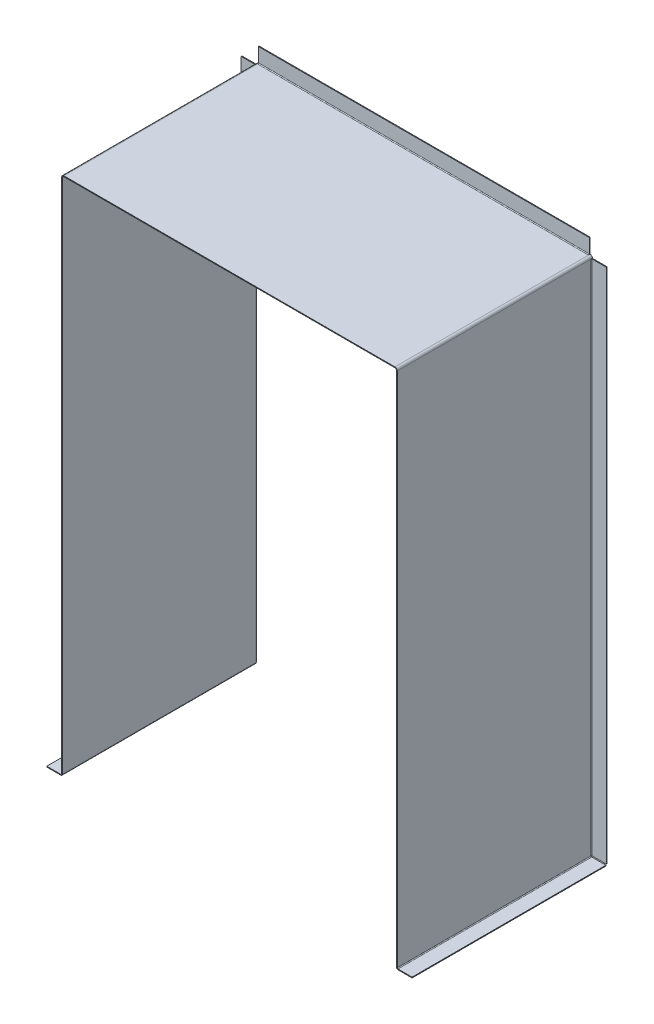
ISO-10303-21;
HEADER;
FILE_DESCRIPTION(('STEP AP214'),'2;1');
FILE_NAME('part.step','',(''),(''),'','','');
FILE_SCHEMA(('AUTOMOTIVE_DESIGN { 1 0 10303 214 1 1 1 1 }'));
ENDSEC;
DATA;
#1=APPLICATION_CONTEXT('core data for automotive mechanical design processes');
#2=APPLICATION_PROTOCOL_DEFINITION('international standard','automotive_design',2000,#1);
#3=PRODUCT_CONTEXT('',#1,'mechanical');
#4=PRODUCT('Part','Part','',(#3));
#5=PRODUCT_RELATED_PRODUCT_CATEGORY('part','',(#4));
#6=PRODUCT_DEFINITION_FORMATION('','',#4);
#7=PRODUCT_DEFINITION_CONTEXT('part definition',#1,'design');
#8=PRODUCT_DEFINITION('design','',#6,#7);
#9=PRODUCT_DEFINITION_SHAPE('','',#8);
#10=(LENGTH_UNIT() NAMED_UNIT(*) SI_UNIT(.MILLI.,.METRE.));
#11=(NAMED_UNIT(*) PLANE_ANGLE_UNIT() SI_UNIT($,.RADIAN.));
#12=(NAMED_UNIT(*) SI_UNIT($,.STERADIAN.) SOLID_ANGLE_UNIT());
#13=UNCERTAINTY_MEASURE_WITH_UNIT(LENGTH_MEASURE(1.E-05),#10,'distance_accuracy_value','');
#14=(GEOMETRIC_REPRESENTATION_CONTEXT(3) GLOBAL_UNCERTAINTY_ASSIGNED_CONTEXT((#13)) GLOBAL_UNIT_ASSIGNED_CONTEXT((#10,
#11,#12)) REPRESENTATION_CONTEXT('',''));
#15=CARTESIAN_POINT('',(0.,0.,0.));
#16=DIRECTION('',(0.,0.,1.));
#17=DIRECTION('',(1.,0.,0.));
#18=AXIS2_PLACEMENT_3D('',#15,#16,#17);
#19=CARTESIAN_POINT('',(-215.,-3.,2.));
#20=DIRECTION('',(0.,-1.,0.));
#21=DIRECTION('',(0.,0.,-1.));
#22=AXIS2_PLACEMENT_3D('',#19,#20,#21);
#23=PLANE('',#22);
#24=DIRECTION('',(0.,0.,-1.));
#25=VECTOR('',#24,1.);
#26=CARTESIAN_POINT('',(-214.,-3.,250.));
#27=LINE('',#26,#25);
#28=CARTESIAN_POINT('',(-214.,-3.,2.));
#29=VERTEX_POINT('',#28);
#30=CARTESIAN_POINT('',(-214.,-3.00000000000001,4.44089209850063E-13));
#31=VERTEX_POINT('',#30);
#32=EDGE_CURVE('E755',#29,#31,#27,.T.);
#33=ORIENTED_EDGE('',*,*,#32,.F.);
#34=CARTESIAN_POINT('',(-216.,-3.,2.));
#35=DIRECTION('',(0.,-1.,0.));
#36=DIRECTION('',(0.,0.,-1.));
#37=AXIS2_PLACEMENT_3D('',#34,#35,#36);
#38=CIRCLE('',#37,2.);
#39=CARTESIAN_POINT('',(-215.,-3.,0.267949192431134));
#40=VERTEX_POINT('',#39);
#41=EDGE_CURVE('E560',#29,#40,#38,.F.);
#42=ORIENTED_EDGE('',*,*,#41,.T.);
#43=DIRECTION('',(0.,0.,-1.));
#44=VECTOR('',#43,1.);
#45=CARTESIAN_POINT('',(-215.,-3.,2.));
#46=LINE('',#45,#44);
#47=CARTESIAN_POINT('',(-215.,-3.,0.));
#48=VERTEX_POINT('',#47);
#49=EDGE_CURVE('E687',#40,#48,#46,.T.);
#50=ORIENTED_EDGE('',*,*,#49,.T.);
#51=DIRECTION('',(-1.,0.,0.));
#52=VECTOR('',#51,1.);
#53=CARTESIAN_POINT('',(1204.00810427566,-3.,0.));
#54=LINE('',#53,#52);
#55=EDGE_CURVE('E779',#31,#48,#54,.T.);
#56=ORIENTED_EDGE('',*,*,#55,.F.);
#57=EDGE_LOOP('',(#33,#42,#50,#56));
#58=FACE_BOUND('',#57,.T.);
#59=ADVANCED_FACE('F139',(#58),#23,.T.);
#60=CARTESIAN_POINT('',(-212.,0.,2.22044604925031E-13));
#61=DIRECTION('',(1.,0.,0.));
#62=DIRECTION('',(0.,0.,-1.));
#63=AXIS2_PLACEMENT_3D('',#60,#61,#62);
#64=PLANE('',#63);
#65=DIRECTION('',(0.,-1.10371781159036E-13,1.));
#66=VECTOR('',#65,1.);
#67=CARTESIAN_POINT('',(-212.,0.,2.22044604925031E-13));
#68=LINE('',#67,#66);
#69=CARTESIAN_POINT('',(-212.,0.,4.44089209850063E-13));
#70=VERTEX_POINT('',#69);
#71=CARTESIAN_POINT('',(-212.,0.,0.26794919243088));
#72=VERTEX_POINT('',#71);
#73=EDGE_CURVE('E692',#70,#72,#68,.T.);
#74=ORIENTED_EDGE('',*,*,#73,.T.);
#75=CARTESIAN_POINT('',(-212.,1.,2.));
#76=DIRECTION('',(-1.,0.,0.));
#77=DIRECTION('',(0.,0.,1.));
#78=AXIS2_PLACEMENT_3D('',#75,#76,#77);
#79=CIRCLE('',#78,2.00000000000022);
#80=CARTESIAN_POINT('',(-212.,-1.,2.));
#81=VERTEX_POINT('',#80);
#82=EDGE_CURVE('E13',#72,#81,#79,.T.);
#83=ORIENTED_EDGE('',*,*,#82,.T.);
#84=DIRECTION('',(0.,0.,-1.));
#85=VECTOR('',#84,1.);
#86=CARTESIAN_POINT('',(-212.,-1.,250.));
#87=LINE('',#86,#85);
#88=CARTESIAN_POINT('',(-212.,-1.,2.22105837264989E-13));
#89=VERTEX_POINT('',#88);
#90=EDGE_CURVE('E737',#81,#89,#87,.T.);
#91=ORIENTED_EDGE('',*,*,#90,.T.);
#92=DIRECTION('',(0.,1.,0.));
#93=VECTOR('',#92,1.);
#94=CARTESIAN_POINT('',(-212.,-984.43080000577,0.));
#95=LINE('',#94,#93);
#96=EDGE_CURVE('E741',#89,#70,#95,.T.);
#97=ORIENTED_EDGE('',*,*,#96,.T.);
#98=EDGE_LOOP('',(#74,#83,#91,#97));
#99=FACE_BOUND('',#98,.T.);
#100=ADVANCED_FACE('F797',(#99),#64,.T.);
#101=CARTESIAN_POINT('',(212.,-2.21610924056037E-13,2.));
#102=DIRECTION('',(-1.,0.,0.));
#103=DIRECTION('',(0.,0.,1.));
#104=AXIS2_PLACEMENT_3D('',#101,#102,#103);
#105=PLANE('',#104);
#106=DIRECTION('',(0.,0.,-1.));
#107=VECTOR('',#106,1.);
#108=CARTESIAN_POINT('',(212.,-0.999999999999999,250.));
#109=LINE('',#108,#107);
#110=CARTESIAN_POINT('',(212.,-0.999999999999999,2.));
#111=VERTEX_POINT('',#110);
#112=CARTESIAN_POINT('',(212.,-0.999999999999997,-4.44089209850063E-13));
#113=VERTEX_POINT('',#112);
#114=EDGE_CURVE('E730',#111,#113,#109,.T.);
#115=ORIENTED_EDGE('',*,*,#114,.F.);
#116=CARTESIAN_POINT('',(212.,1.,2.));
#117=DIRECTION('',(-1.,0.,0.));
#118=DIRECTION('',(0.,0.,1.));
#119=AXIS2_PLACEMENT_3D('',#116,#117,#118);
#120=CIRCLE('',#119,2.00000000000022);
#121=CARTESIAN_POINT('',(212.,0.,0.26794919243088));
#122=VERTEX_POINT('',#121);
#123=EDGE_CURVE('E810',#111,#122,#120,.F.);
#124=ORIENTED_EDGE('',*,*,#123,.T.);
#125=DIRECTION('',(0.,1.10805462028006E-13,-1.));
#126=VECTOR('',#125,1.);
#127=CARTESIAN_POINT('',(212.,-2.21610924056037E-13,2.));
#128=LINE('',#127,#126);
#129=CARTESIAN_POINT('',(212.,0.,0.));
#130=VERTEX_POINT('',#129);
#131=EDGE_CURVE('E691',#122,#130,#128,.T.);
#132=ORIENTED_EDGE('',*,*,#131,.T.);
#133=DIRECTION('',(0.,1.,0.));
#134=VECTOR('',#133,1.);
#135=CARTESIAN_POINT('',(212.,-984.43080000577,0.));
#136=LINE('',#135,#134);
#137=EDGE_CURVE('E748',#113,#130,#136,.T.);
#138=ORIENTED_EDGE('',*,*,#137,.F.);
#139=EDGE_LOOP('',(#115,#124,#132,#138));
#140=FACE_BOUND('',#139,.T.);
#141=ADVANCED_FACE('F1024',(#140),#105,.T.);
#142=CARTESIAN_POINT('',(215.,-3.,-4.44089209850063E-13));
#143=DIRECTION('',(0.,-1.,0.));
#144=DIRECTION('',(0.,0.,-1.));
#145=AXIS2_PLACEMENT_3D('',#142,#143,#144);
#146=PLANE('',#145);
#147=DIRECTION('',(0.,0.,1.));
#148=VECTOR('',#147,1.);
#149=CARTESIAN_POINT('',(215.,-3.,-4.44089209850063E-13));
#150=LINE('',#149,#148);
#151=CARTESIAN_POINT('',(215.,-3.,-4.44089209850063E-13));
#152=VERTEX_POINT('',#151);
#153=CARTESIAN_POINT('',(215.,-3.,0.267949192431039));
#154=VERTEX_POINT('',#153);
#155=EDGE_CURVE('E697',#152,#154,#150,.T.);
#156=ORIENTED_EDGE('',*,*,#155,.T.);
#157=CARTESIAN_POINT('',(216.,-3.,1.99999999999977));
#158=DIRECTION('',(0.,1.,0.));
#159=DIRECTION('',(0.,0.,1.));
#160=AXIS2_PLACEMENT_3D('',#157,#158,#159);
#161=CIRCLE('',#160,1.99999999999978);
#162=CARTESIAN_POINT('',(214.,-3.,1.99999999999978));
#163=VERTEX_POINT('',#162);
#164=EDGE_CURVE('E148',#154,#163,#161,.T.);
#165=ORIENTED_EDGE('',*,*,#164,.T.);
#166=DIRECTION('',(0.,0.,-1.));
#167=VECTOR('',#166,1.);
#168=CARTESIAN_POINT('',(214.,-3.,250.));
#169=LINE('',#168,#167);
#170=CARTESIAN_POINT('',(214.,-3.,-4.44027977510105E-13));
#171=VERTEX_POINT('',#170);
#172=EDGE_CURVE('E756',#163,#171,#169,.T.);
#173=ORIENTED_EDGE('',*,*,#172,.T.);
#174=DIRECTION('',(1.,0.,0.));
#175=VECTOR('',#174,1.);
#176=CARTESIAN_POINT('',(-1204.00810427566,-3.,0.));
#177=LINE('',#176,#175);
#178=EDGE_CURVE('E763',#171,#152,#177,.T.);
#179=ORIENTED_EDGE('',*,*,#178,.T.);
#180=EDGE_LOOP('',(#156,#165,#173,#179));
#181=FACE_BOUND('',#180,.T.);
#182=ADVANCED_FACE('F1017',(#181),#146,.T.);
#183=CARTESIAN_POINT('',(-215.,-667.,250.));
#184=DIRECTION('',(-1.,0.,0.));
#185=DIRECTION('',(0.,0.,1.));
#186=AXIS2_PLACEMENT_3D('',#183,#184,#185);
#187=PLANE('',#186);
#188=DIRECTION('',(0.,-1.,0.));
#189=VECTOR('',#188,1.);
#190=CARTESIAN_POINT('',(-215.,-665.292893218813,2.));
#191=LINE('',#190,#189);
#192=CARTESIAN_POINT('',(-215.,-665.,2.));
#193=VERTEX_POINT('',#192);
#194=CARTESIAN_POINT('',(-215.,-3.,2.));
#195=VERTEX_POINT('',#194);
#196=EDGE_CURVE('E569',#193,#195,#191,.F.);
#197=ORIENTED_EDGE('',*,*,#196,.F.);
#198=DIRECTION('',(0.,0.,1.));
#199=VECTOR('',#198,1.);
#200=CARTESIAN_POINT('',(-215.,-665.,250.));
#201=LINE('',#200,#199);
#202=CARTESIAN_POINT('',(-215.,-665.,250.));
#203=VERTEX_POINT('',#202);
#204=EDGE_CURVE('E437',#203,#193,#201,.F.);
#205=ORIENTED_EDGE('',*,*,#204,.F.);
#206=DIRECTION('',(0.,1.,0.));
#207=VECTOR('',#206,1.);
#208=CARTESIAN_POINT('',(-215.,-667.,250.));
#209=LINE('',#208,#207);
#210=CARTESIAN_POINT('',(-215.,-3.,250.));
#211=VERTEX_POINT('',#210);
#212=EDGE_CURVE('E773',#203,#211,#209,.T.);
#213=ORIENTED_EDGE('',*,*,#212,.T.);
#214=DIRECTION('',(0.,0.,-1.));
#215=VECTOR('',#214,1.);
#216=CARTESIAN_POINT('',(-215.,-3.,250.));
#217=LINE('',#216,#215);
#218=EDGE_CURVE('E770',#211,#195,#217,.T.);
#219=ORIENTED_EDGE('',*,*,#218,.T.);
#220=EDGE_LOOP('',(#197,#205,#213,#219));
#221=FACE_BOUND('',#220,.T.);
#222=ADVANCED_FACE('F988',(#221),#187,.T.);
#223=CARTESIAN_POINT('',(-214.,-667.,250.));
#224=DIRECTION('',(-1.,0.,0.));
#225=DIRECTION('',(0.,0.,1.));
#226=AXIS2_PLACEMENT_3D('',#223,#224,#225);
#227=PLANE('',#226);
#228=DIRECTION('',(0.,0.,1.));
#229=VECTOR('',#228,1.);
#230=CARTESIAN_POINT('',(-214.,-665.,250.));
#231=LINE('',#230,#229);
#232=CARTESIAN_POINT('',(-214.,-665.,250.));
#233=VERTEX_POINT('',#232);
#234=CARTESIAN_POINT('',(-214.,-665.,2.));
#235=VERTEX_POINT('',#234);
#236=EDGE_CURVE('E433',#233,#235,#231,.F.);
#237=ORIENTED_EDGE('',*,*,#236,.T.);
#238=DIRECTION('',(0.,-1.,0.));
#239=VECTOR('',#238,1.);
#240=CARTESIAN_POINT('',(-214.,-665.292893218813,2.));
#241=LINE('',#240,#239);
#242=EDGE_CURVE('E968',#235,#29,#241,.F.);
#243=ORIENTED_EDGE('',*,*,#242,.T.);
#244=CARTESIAN_POINT('',(-214.,-3.,250.));
#245=VERTEX_POINT('',#244);
#246=EDGE_CURVE('E143',#245,#29,#27,.T.);
#247=ORIENTED_EDGE('',*,*,#246,.F.);
#248=DIRECTION('',(0.,1.,0.));
#249=VECTOR('',#248,1.);
#250=CARTESIAN_POINT('',(-214.,-667.,250.));
#251=LINE('',#250,#249);
#252=EDGE_CURVE('E775',#233,#245,#251,.T.);
#253=ORIENTED_EDGE('',*,*,#252,.F.);
#254=EDGE_LOOP('',(#237,#243,#247,#253));
#255=FACE_BOUND('',#254,.T.);
#256=ADVANCED_FACE('F141',(#255),#227,.F.);
#257=CARTESIAN_POINT('',(1204.00810427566,-667.,250.));
#258=DIRECTION('',(0.,0.,1.));
#259=DIRECTION('',(0.,1.,0.));
#260=AXIS2_PLACEMENT_3D('',#257,#258,#259);
#261=PLANE('',#260);
#262=ORIENTED_EDGE('',*,*,#212,.F.);
#263=DIRECTION('',(1.,0.,0.));
#264=VECTOR('',#263,1.);
#265=CARTESIAN_POINT('',(-215.,-665.,250.));
#266=LINE('',#265,#264);
#267=EDGE_CURVE('E929',#203,#233,#266,.T.);
#268=ORIENTED_EDGE('',*,*,#267,.T.);
#269=ORIENTED_EDGE('',*,*,#252,.T.);
#270=DIRECTION('',(-1.,0.,0.));
#271=VECTOR('',#270,1.);
#272=CARTESIAN_POINT('',(1204.00810427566,-3.,250.));
#273=LINE('',#272,#271);
#274=EDGE_CURVE('E777',#245,#211,#273,.T.);
#275=ORIENTED_EDGE('',*,*,#274,.T.);
#276=EDGE_LOOP('',(#262,#268,#269,#275));
#277=FACE_BOUND('',#276,.T.);
#278=ADVANCED_FACE('F992',(#277),#261,.T.);
#279=CARTESIAN_POINT('',(215.,-3.,250.));
#280=DIRECTION('',(1.,0.,0.));
#281=DIRECTION('',(0.,0.,-1.));
#282=AXIS2_PLACEMENT_3D('',#279,#280,#281);
#283=PLANE('',#282);
#284=DIRECTION('',(0.,-1.,0.));
#285=VECTOR('',#284,1.);
#286=CARTESIAN_POINT('',(215.,-3.,250.));
#287=LINE('',#286,#285);
#288=CARTESIAN_POINT('',(215.,-3.,250.));
#289=VERTEX_POINT('',#288);
#290=CARTESIAN_POINT('',(215.,-665.,250.));
#291=VERTEX_POINT('',#290);
#292=EDGE_CURVE('E760',#289,#291,#287,.T.);
#293=ORIENTED_EDGE('',*,*,#292,.T.);
#294=DIRECTION('',(0.,0.,-1.));
#295=VECTOR('',#294,1.);
#296=CARTESIAN_POINT('',(215.,-665.,1.70710678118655));
#297=LINE('',#296,#295);
#298=CARTESIAN_POINT('',(215.,-665.,2.00000000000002));
#299=VERTEX_POINT('',#298);
#300=EDGE_CURVE('E522',#299,#291,#297,.F.);
#301=ORIENTED_EDGE('',*,*,#300,.F.);
#302=DIRECTION('',(0.,1.,0.));
#303=VECTOR('',#302,1.);
#304=CARTESIAN_POINT('',(215.,-3.,1.99999999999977));
#305=LINE('',#304,#303);
#306=CARTESIAN_POINT('',(215.,-3.,1.99999999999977));
#307=VERTEX_POINT('',#306);
#308=EDGE_CURVE('E864',#307,#299,#305,.F.);
#309=ORIENTED_EDGE('',*,*,#308,.F.);
#310=DIRECTION('',(0.,0.,-1.));
#311=VECTOR('',#310,1.);
#312=CARTESIAN_POINT('',(215.,-3.,250.));
#313=LINE('',#312,#311);
#314=EDGE_CURVE('E766',#289,#307,#313,.T.);
#315=ORIENTED_EDGE('',*,*,#314,.F.);
#316=EDGE_LOOP('',(#293,#301,#309,#315));
#317=FACE_BOUND('',#316,.T.);
#318=ADVANCED_FACE('F1120',(#317),#283,.T.);
#319=CARTESIAN_POINT('',(214.,-3.,250.));
#320=DIRECTION('',(1.,0.,0.));
#321=DIRECTION('',(0.,0.,-1.));
#322=AXIS2_PLACEMENT_3D('',#319,#320,#321);
#323=PLANE('',#322);
#324=DIRECTION('',(0.,0.,-1.));
#325=VECTOR('',#324,1.);
#326=CARTESIAN_POINT('',(214.,-665.,1.70710678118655));
#327=LINE('',#326,#325);
#328=CARTESIAN_POINT('',(214.,-665.,2.));
#329=VERTEX_POINT('',#328);
#330=CARTESIAN_POINT('',(214.,-665.,250.));
#331=VERTEX_POINT('',#330);
#332=EDGE_CURVE('E510',#329,#331,#327,.F.);
#333=ORIENTED_EDGE('',*,*,#332,.T.);
#334=DIRECTION('',(0.,1.,0.));
#335=VECTOR('',#334,1.);
#336=CARTESIAN_POINT('',(214.,-3.,250.));
#337=LINE('',#336,#335);
#338=CARTESIAN_POINT('',(214.,-3.,250.));
#339=VERTEX_POINT('',#338);
#340=EDGE_CURVE('E757',#339,#331,#337,.F.);
#341=ORIENTED_EDGE('',*,*,#340,.F.);
#342=EDGE_CURVE('E752',#339,#163,#169,.T.);
#343=ORIENTED_EDGE('',*,*,#342,.T.);
#344=DIRECTION('',(0.,1.,0.));
#345=VECTOR('',#344,1.);
#346=CARTESIAN_POINT('',(214.,-3.,1.99999999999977));
#347=LINE('',#346,#345);
#348=EDGE_CURVE('E678',#163,#329,#347,.F.);
#349=ORIENTED_EDGE('',*,*,#348,.T.);
#350=EDGE_LOOP('',(#333,#341,#343,#349));
#351=FACE_BOUND('',#350,.T.);
#352=ADVANCED_FACE('F901',(#351),#323,.F.);
#353=CARTESIAN_POINT('',(-212.,-1.,250.));
#354=DIRECTION('',(0.,1.,0.));
#355=DIRECTION('',(0.,0.,1.));
#356=AXIS2_PLACEMENT_3D('',#353,#354,#355);
#357=PLANE('',#356);
#358=DIRECTION('',(-1.,0.,0.));
#359=VECTOR('',#358,1.);
#360=CARTESIAN_POINT('',(-212.,-1.00000000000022,2.));
#361=LINE('',#360,#359);
#362=EDGE_CURVE('E804',#81,#111,#361,.F.);
#363=ORIENTED_EDGE('',*,*,#362,.T.);
#364=CARTESIAN_POINT('',(212.,-0.999999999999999,250.));
#365=VERTEX_POINT('',#364);
#366=EDGE_CURVE('E731',#365,#111,#109,.T.);
#367=ORIENTED_EDGE('',*,*,#366,.F.);
#368=DIRECTION('',(1.,0.,0.));
#369=VECTOR('',#368,1.);
#370=CARTESIAN_POINT('',(-212.,-1.,250.));
#371=LINE('',#370,#369);
#372=CARTESIAN_POINT('',(-212.,-1.,250.));
#373=VERTEX_POINT('',#372);
#374=EDGE_CURVE('E734',#373,#365,#371,.T.);
#375=ORIENTED_EDGE('',*,*,#374,.F.);
#376=EDGE_CURVE('E738',#373,#81,#87,.T.);
#377=ORIENTED_EDGE('',*,*,#376,.T.);
#378=EDGE_LOOP('',(#363,#367,#375,#377));
#379=FACE_BOUND('',#378,.T.);
#380=ADVANCED_FACE('F803',(#379),#357,.F.);
#381=CARTESIAN_POINT('',(-212.,0.,250.));
#382=DIRECTION('',(0.,1.,0.));
#383=DIRECTION('',(0.,0.,1.));
#384=AXIS2_PLACEMENT_3D('',#381,#382,#383);
#385=PLANE('',#384);
#386=DIRECTION('',(0.,0.,-1.));
#387=VECTOR('',#386,1.);
#388=CARTESIAN_POINT('',(212.,0.,250.));
#389=LINE('',#388,#387);
#390=CARTESIAN_POINT('',(212.,0.,250.));
#391=VERTEX_POINT('',#390);
#392=CARTESIAN_POINT('',(212.,0.,2.));
#393=VERTEX_POINT('',#392);
#394=EDGE_CURVE('E727',#391,#393,#389,.T.);
#395=ORIENTED_EDGE('',*,*,#394,.T.);
#396=DIRECTION('',(-1.,0.,0.));
#397=VECTOR('',#396,1.);
#398=CARTESIAN_POINT('',(-212.,-2.21610924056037E-13,2.));
#399=LINE('',#398,#397);
#400=CARTESIAN_POINT('',(-212.,0.,2.));
#401=VERTEX_POINT('',#400);
#402=EDGE_CURVE('E822',#401,#393,#399,.F.);
#403=ORIENTED_EDGE('',*,*,#402,.F.);
#404=DIRECTION('',(0.,0.,-1.));
#405=VECTOR('',#404,1.);
#406=CARTESIAN_POINT('',(-212.,0.,250.));
#407=LINE('',#406,#405);
#408=CARTESIAN_POINT('',(-212.,0.,250.));
#409=VERTEX_POINT('',#408);
#410=EDGE_CURVE('E718',#409,#401,#407,.T.);
#411=ORIENTED_EDGE('',*,*,#410,.F.);
#412=DIRECTION('',(1.,0.,0.));
#413=VECTOR('',#412,1.);
#414=CARTESIAN_POINT('',(-212.,0.,250.));
#415=LINE('',#414,#413);
#416=EDGE_CURVE('E724',#409,#391,#415,.T.);
#417=ORIENTED_EDGE('',*,*,#416,.T.);
#418=EDGE_LOOP('',(#395,#403,#411,#417));
#419=FACE_BOUND('',#418,.T.);
#420=ADVANCED_FACE('F1001',(#419),#385,.T.);
#421=CARTESIAN_POINT('',(-1204.00810427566,-3.,250.));
#422=DIRECTION('',(0.,0.,1.));
#423=DIRECTION('',(0.,-1.,0.));
#424=AXIS2_PLACEMENT_3D('',#421,#422,#423);
#425=PLANE('',#424);
#426=DIRECTION('',(-1.,0.,0.));
#427=VECTOR('',#426,1.);
#428=CARTESIAN_POINT('',(215.,-665.,250.));
#429=LINE('',#428,#427);
#430=EDGE_CURVE('E525',#291,#331,#429,.T.);
#431=ORIENTED_EDGE('',*,*,#430,.F.);
#432=ORIENTED_EDGE('',*,*,#292,.F.);
#433=DIRECTION('',(1.,0.,0.));
#434=VECTOR('',#433,1.);
#435=CARTESIAN_POINT('',(-1204.00810427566,-3.,250.));
#436=LINE('',#435,#434);
#437=EDGE_CURVE('E751',#339,#289,#436,.T.);
#438=ORIENTED_EDGE('',*,*,#437,.F.);
#439=ORIENTED_EDGE('',*,*,#340,.T.);
#440=EDGE_LOOP('',(#431,#432,#438,#439));
#441=FACE_BOUND('',#440,.T.);
#442=ADVANCED_FACE('F1115',(#441),#425,.T.);
#443=CARTESIAN_POINT('',(-212.,-984.43080000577,250.));
#444=DIRECTION('',(0.,0.,1.));
#445=DIRECTION('',(1.,0.,0.));
#446=AXIS2_PLACEMENT_3D('',#443,#444,#445);
#447=PLANE('',#446);
#448=DIRECTION('',(0.,1.,0.));
#449=VECTOR('',#448,1.);
#450=CARTESIAN_POINT('',(212.,-984.43080000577,250.));
#451=LINE('',#450,#449);
#452=EDGE_CURVE('E746',#365,#391,#451,.T.);
#453=ORIENTED_EDGE('',*,*,#452,.T.);
#454=ORIENTED_EDGE('',*,*,#416,.F.);
#455=DIRECTION('',(0.,1.,0.));
#456=VECTOR('',#455,1.);
#457=CARTESIAN_POINT('',(-212.,-984.43080000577,250.));
#458=LINE('',#457,#456);
#459=EDGE_CURVE('E744',#373,#409,#458,.T.);
#460=ORIENTED_EDGE('',*,*,#459,.F.);
#461=ORIENTED_EDGE('',*,*,#374,.T.);
#462=EDGE_LOOP('',(#453,#454,#460,#461));
#463=FACE_BOUND('',#462,.T.);
#464=ADVANCED_FACE('F1004',(#463),#447,.T.);
#465=CARTESIAN_POINT('',(212.,-3.,0.));
#466=DIRECTION('',(0.,0.,-1.));
#467=DIRECTION('',(-1.,0.,0.));
#468=AXIS2_PLACEMENT_3D('',#465,#466,#467);
#469=PLANE('',#468);
#470=ORIENTED_EDGE('',*,*,#178,.F.);
#471=CARTESIAN_POINT('',(212.,-3.,-4.44089209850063E-13));
#472=DIRECTION('',(0.,0.,1.));
#473=DIRECTION('',(1.,0.,0.));
#474=AXIS2_PLACEMENT_3D('',#471,#472,#473);
#475=CIRCLE('',#474,2.);
#476=EDGE_CURVE('E707',#171,#113,#475,.T.);
#477=ORIENTED_EDGE('',*,*,#476,.T.);
#478=ORIENTED_EDGE('',*,*,#137,.T.);
#479=CARTESIAN_POINT('',(212.,-3.,-4.44089209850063E-13));
#480=DIRECTION('',(0.,0.,1.));
#481=DIRECTION('',(1.,0.,0.));
#482=AXIS2_PLACEMENT_3D('',#479,#480,#481);
#483=CIRCLE('',#482,3.);
#484=EDGE_CURVE('E711',#152,#130,#483,.T.);
#485=ORIENTED_EDGE('',*,*,#484,.F.);
#486=EDGE_LOOP('',(#470,#477,#478,#485));
#487=FACE_BOUND('',#486,.T.);
#488=ADVANCED_FACE('F1021',(#487),#469,.T.);
#489=CARTESIAN_POINT('',(212.,-3.,250.));
#490=DIRECTION('',(0.,0.,1.));
#491=DIRECTION('',(1.,0.,0.));
#492=AXIS2_PLACEMENT_3D('',#489,#490,#491);
#493=PLANE('',#492);
#494=CARTESIAN_POINT('',(212.,-3.,249.999999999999));
#495=DIRECTION('',(0.,0.,1.));
#496=DIRECTION('',(1.,0.,0.));
#497=AXIS2_PLACEMENT_3D('',#494,#495,#496);
#498=CIRCLE('',#497,2.);
#499=EDGE_CURVE('E715',#365,#339,#498,.F.);
#500=ORIENTED_EDGE('',*,*,#499,.T.);
#501=ORIENTED_EDGE('',*,*,#437,.T.);
#502=CARTESIAN_POINT('',(212.,-3.,249.999999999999));
#503=DIRECTION('',(0.,0.,1.));
#504=DIRECTION('',(1.,0.,0.));
#505=AXIS2_PLACEMENT_3D('',#502,#503,#504);
#506=CIRCLE('',#505,3.);
#507=EDGE_CURVE('E714',#391,#289,#506,.F.);
#508=ORIENTED_EDGE('',*,*,#507,.F.);
#509=ORIENTED_EDGE('',*,*,#452,.F.);
#510=EDGE_LOOP('',(#500,#501,#508,#509));
#511=FACE_BOUND('',#510,.T.);
#512=ADVANCED_FACE('F1008',(#511),#493,.T.);
#513=CARTESIAN_POINT('',(212.,-3.,-1777.52272465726));
#514=DIRECTION('',(0.,0.,1.));
#515=DIRECTION('',(1.,0.,0.));
#516=AXIS2_PLACEMENT_3D('',#513,#514,#515);
#517=CYLINDRICAL_SURFACE('',#516,3.);
#518=ORIENTED_EDGE('',*,*,#394,.F.);
#519=ORIENTED_EDGE('',*,*,#507,.T.);
#520=ORIENTED_EDGE('',*,*,#314,.T.);
#521=EDGE_CURVE('E165',#154,#307,#150,.T.);
#522=ORIENTED_EDGE('',*,*,#521,.F.);
#523=ORIENTED_EDGE('',*,*,#155,.F.);
#524=ORIENTED_EDGE('',*,*,#484,.T.);
#525=ORIENTED_EDGE('',*,*,#131,.F.);
#526=EDGE_CURVE('E694',#393,#122,#128,.T.);
#527=ORIENTED_EDGE('',*,*,#526,.F.);
#528=EDGE_LOOP('',(#518,#519,#520,#522,#523,#524,#525,#527));
#529=FACE_BOUND('',#528,.T.);
#530=ADVANCED_FACE('F1019',(#529),#517,.T.);
#531=CARTESIAN_POINT('',(212.,-3.,-1777.52272465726));
#532=DIRECTION('',(0.,0.,1.));
#533=DIRECTION('',(1.,0.,0.));
#534=AXIS2_PLACEMENT_3D('',#531,#532,#533);
#535=CYLINDRICAL_SURFACE('',#534,2.);
#536=ORIENTED_EDGE('',*,*,#366,.T.);
#537=ORIENTED_EDGE('',*,*,#114,.T.);
#538=ORIENTED_EDGE('',*,*,#476,.F.);
#539=ORIENTED_EDGE('',*,*,#172,.F.);
#540=ORIENTED_EDGE('',*,*,#342,.F.);
#541=ORIENTED_EDGE('',*,*,#499,.F.);
#542=EDGE_LOOP('',(#536,#537,#538,#539,#540,#541));
#543=FACE_BOUND('',#542,.T.);
#544=ADVANCED_FACE('F1011',(#543),#535,.F.);
#545=CARTESIAN_POINT('',(-212.,-3.,0.));
#546=DIRECTION('',(0.,0.,-1.));
#547=DIRECTION('',(-1.,0.,0.));
#548=AXIS2_PLACEMENT_3D('',#545,#546,#547);
#549=PLANE('',#548);
#550=ORIENTED_EDGE('',*,*,#96,.F.);
#551=CARTESIAN_POINT('',(-212.,-3.,4.44089209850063E-13));
#552=DIRECTION('',(0.,0.,-1.));
#553=DIRECTION('',(-1.,0.,0.));
#554=AXIS2_PLACEMENT_3D('',#551,#552,#553);
#555=CIRCLE('',#554,2.);
#556=EDGE_CURVE('E704',#89,#31,#555,.F.);
#557=ORIENTED_EDGE('',*,*,#556,.T.);
#558=ORIENTED_EDGE('',*,*,#55,.T.);
#559=CARTESIAN_POINT('',(-212.,-3.,4.44089209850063E-13));
#560=DIRECTION('',(0.,0.,-1.));
#561=DIRECTION('',(-1.,0.,0.));
#562=AXIS2_PLACEMENT_3D('',#559,#560,#561);
#563=CIRCLE('',#562,3.);
#564=EDGE_CURVE('E703',#70,#48,#563,.F.);
#565=ORIENTED_EDGE('',*,*,#564,.F.);
#566=EDGE_LOOP('',(#550,#557,#558,#565));
#567=FACE_BOUND('',#566,.T.);
#568=ADVANCED_FACE('F795',(#567),#549,.T.);
#569=CARTESIAN_POINT('',(-212.,-3.,250.));
#570=DIRECTION('',(0.,0.,1.));
#571=DIRECTION('',(1.,0.,0.));
#572=AXIS2_PLACEMENT_3D('',#569,#570,#571);
#573=PLANE('',#572);
#574=ORIENTED_EDGE('',*,*,#274,.F.);
#575=CARTESIAN_POINT('',(-212.,-3.,250.));
#576=DIRECTION('',(0.,0.,-1.));
#577=DIRECTION('',(-1.,0.,0.));
#578=AXIS2_PLACEMENT_3D('',#575,#576,#577);
#579=CIRCLE('',#578,2.);
#580=EDGE_CURVE('E699',#245,#373,#579,.T.);
#581=ORIENTED_EDGE('',*,*,#580,.T.);
#582=ORIENTED_EDGE('',*,*,#459,.T.);
#583=CARTESIAN_POINT('',(-212.,-3.,250.));
#584=DIRECTION('',(0.,0.,-1.));
#585=DIRECTION('',(-1.,0.,0.));
#586=AXIS2_PLACEMENT_3D('',#583,#584,#585);
#587=CIRCLE('',#586,3.);
#588=EDGE_CURVE('E700',#211,#409,#587,.T.);
#589=ORIENTED_EDGE('',*,*,#588,.F.);
#590=EDGE_LOOP('',(#574,#581,#582,#589));
#591=FACE_BOUND('',#590,.T.);
#592=ADVANCED_FACE('F996',(#591),#573,.T.);
#593=CARTESIAN_POINT('',(-212.,-3.,1556.23662298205));
#594=DIRECTION('',(0.,0.,-1.));
#595=DIRECTION('',(-1.,0.,0.));
#596=AXIS2_PLACEMENT_3D('',#593,#594,#595);
#597=CYLINDRICAL_SURFACE('',#596,3.);
#598=ORIENTED_EDGE('',*,*,#588,.T.);
#599=ORIENTED_EDGE('',*,*,#410,.T.);
#600=EDGE_CURVE('E157',#72,#401,#68,.T.);
#601=ORIENTED_EDGE('',*,*,#600,.F.);
#602=ORIENTED_EDGE('',*,*,#73,.F.);
#603=ORIENTED_EDGE('',*,*,#564,.T.);
#604=ORIENTED_EDGE('',*,*,#49,.F.);
#605=EDGE_CURVE('E688',#195,#40,#46,.T.);
#606=ORIENTED_EDGE('',*,*,#605,.F.);
#607=ORIENTED_EDGE('',*,*,#218,.F.);
#608=EDGE_LOOP('',(#598,#599,#601,#602,#603,#604,#606,#607));
#609=FACE_BOUND('',#608,.T.);
#610=ADVANCED_FACE('F998',(#609),#597,.T.);
#611=CARTESIAN_POINT('',(-212.,-3.,1556.23662298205));
#612=DIRECTION('',(0.,0.,-1.));
#613=DIRECTION('',(-1.,0.,0.));
#614=AXIS2_PLACEMENT_3D('',#611,#612,#613);
#615=CYLINDRICAL_SURFACE('',#614,2.);
#616=ORIENTED_EDGE('',*,*,#580,.F.);
#617=ORIENTED_EDGE('',*,*,#246,.T.);
#618=ORIENTED_EDGE('',*,*,#32,.T.);
#619=ORIENTED_EDGE('',*,*,#556,.F.);
#620=ORIENTED_EDGE('',*,*,#90,.F.);
#621=ORIENTED_EDGE('',*,*,#376,.F.);
#622=EDGE_LOOP('',(#616,#617,#618,#619,#620,#621));
#623=FACE_BOUND('',#622,.T.);
#624=ADVANCED_FACE('F790',(#623),#615,.F.);
#625=CARTESIAN_POINT('',(213.99,-665.,1.99999999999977));
#626=CARTESIAN_POINT('',(213.99,-665.024412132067,1.73684458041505));
#627=CARTESIAN_POINT('',(214.042314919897,-665.048815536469,1.47388675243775));
#628=CARTESIAN_POINT('',(214.243689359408,-665.097631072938,0.987725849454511));
#629=CARTESIAN_POINT('',(214.39266964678,-665.122038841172,0.764761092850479));
#630=CARTESIAN_POINT('',(214.76476109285,-665.170854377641,0.392669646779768));
#631=CARTESIAN_POINT('',(214.987725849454,-665.195262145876,0.243689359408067));
#632=CARTESIAN_POINT('',(215.473886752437,-665.244077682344,0.042314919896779));
#633=CARTESIAN_POINT('',(215.736844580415,-665.268481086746,-0.00999999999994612));
#634=CARTESIAN_POINT('',(215.999999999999,-665.292893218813,-0.0100000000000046));
#635=CARTESIAN_POINT('',(214.,-665.,1.99999999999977));
#636=CARTESIAN_POINT('',(214.,-665.024412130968,1.73815381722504));
#637=CARTESIAN_POINT('',(214.052054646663,-665.048815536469,1.47650423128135));
#638=CARTESIAN_POINT('',(214.252427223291,-665.097631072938,0.99276203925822));
#639=CARTESIAN_POINT('',(214.400666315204,-665.122038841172,0.770906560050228));
#640=CARTESIAN_POINT('',(214.77090656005,-665.170854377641,0.400666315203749));
#641=CARTESIAN_POINT('',(214.992762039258,-665.195262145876,0.252427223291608));
#642=CARTESIAN_POINT('',(215.476504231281,-665.244077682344,0.0520546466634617));
#643=CARTESIAN_POINT('',(215.738153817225,-665.268481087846,0.));
#644=CARTESIAN_POINT('',(215.999999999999,-665.292893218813,0.));
#645=CARTESIAN_POINT('',(215.,-665.,1.99999999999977));
#646=CARTESIAN_POINT('',(215.,-665.024412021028,1.86907749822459));
#647=CARTESIAN_POINT('',(215.026027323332,-665.048815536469,1.73825211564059));
#648=CARTESIAN_POINT('',(215.126213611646,-665.097631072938,1.49638101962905));
#649=CARTESIAN_POINT('',(215.200333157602,-665.122038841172,1.38545328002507));
#650=CARTESIAN_POINT('',(215.385453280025,-665.170854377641,1.20033315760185));
#651=CARTESIAN_POINT('',(215.496381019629,-665.195262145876,1.12621361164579));
#652=CARTESIAN_POINT('',(215.73825211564,-665.244077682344,1.02602732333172));
#653=CARTESIAN_POINT('',(215.869077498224,-665.268481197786,1.00000000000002));
#654=CARTESIAN_POINT('',(216.,-665.292893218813,0.999999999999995));
#655=CARTESIAN_POINT('',(215.0101,-665.,1.99999999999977));
#656=CARTESIAN_POINT('',(215.0101,-665.024412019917,1.87039982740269));
#657=CARTESIAN_POINT('',(215.035864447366,-665.048815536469,1.74089576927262));
#658=CARTESIAN_POINT('',(215.135038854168,-665.097631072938,1.5014675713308));
#659=CARTESIAN_POINT('',(215.20840979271,-665.122038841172,1.39166020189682));
#660=CARTESIAN_POINT('',(215.391660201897,-665.170854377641,1.20840979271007));
#661=CARTESIAN_POINT('',(215.501467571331,-665.195262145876,1.13503885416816));
#662=CARTESIAN_POINT('',(215.740895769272,-665.244077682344,1.03586444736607));
#663=CARTESIAN_POINT('',(215.870399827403,-665.268481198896,1.01010000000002));
#664=CARTESIAN_POINT('',(216.,-665.292893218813,1.0101));
#665=B_SPLINE_SURFACE_WITH_KNOTS('',1,3,((#625,#626,#627,#628,#629,#630,#631,#632,#633,#634),
(#635,#636,#637,#638,#639,#640,#641,#642,#643,#644),(#645,#646,#647,#648,#649,#650,#651,#652,
#653,#654),(#655,#656,#657,#658,#659,#660,#661,#662,#663,#664)),.UNSPECIFIED.,.F.,.F.,.F.,(2,1,
1,2),(4,2,2,2,4),(-0.01,0.,1.,1.0101),(0.,0.25,0.5,0.75,1.),.UNSPECIFIED.);
#666=DIRECTION('',(0.,0.,1.));
#667=VECTOR('',#666,1.);
#668=CARTESIAN_POINT('',(216.,-665.292893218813,1.));
#669=LINE('',#668,#667);
#670=CARTESIAN_POINT('',(216.,-665.292893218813,0.));
#671=VERTEX_POINT('',#670);
#672=CARTESIAN_POINT('',(216.,-665.292893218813,0.999999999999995));
#673=VERTEX_POINT('',#672);
#674=EDGE_CURVE('E829',#671,#673,#669,.T.);
#675=CARTESIAN_POINT('',(215.,-665.,1.99999999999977));
#676=CARTESIAN_POINT('',(214.999999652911,-665.00305097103,1.98363752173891));
#677=CARTESIAN_POINT('',(215.000401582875,-665.006101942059,1.96727507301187));
#678=CARTESIAN_POINT('',(215.002007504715,-665.012203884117,1.93458957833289));
#679=CARTESIAN_POINT('',(215.003211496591,-665.015254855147,1.91826653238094));
#680=CARTESIAN_POINT('',(215.006419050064,-665.021356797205,1.88569918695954));
#681=CARTESIAN_POINT('',(215.008422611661,-665.024407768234,1.86945488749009));
#682=CARTESIAN_POINT('',(215.013224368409,-665.030509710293,1.83708416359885));
#683=CARTESIAN_POINT('',(215.01602256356,-665.033560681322,1.82095773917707));
#684=CARTESIAN_POINT('',(215.022406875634,-665.039662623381,1.78886161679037));
#685=CARTESIAN_POINT('',(215.025992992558,-665.04271359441,1.77289191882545));
#686=CARTESIAN_POINT('',(215.033944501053,-665.048815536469,1.74114772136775));
#687=CARTESIAN_POINT('',(215.038309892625,-665.051866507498,1.72537322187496));
#688=CARTESIAN_POINT('',(215.047809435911,-665.057968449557,1.69405742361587));
#689=CARTESIAN_POINT('',(215.052943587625,-665.061019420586,1.67851612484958));
#690=CARTESIAN_POINT('',(215.063968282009,-665.067121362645,1.64770416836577));
#691=CARTESIAN_POINT('',(215.06985882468,-665.070172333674,1.63243351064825));
#692=CARTESIAN_POINT('',(215.082382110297,-665.076274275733,1.6021996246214));
#693=CARTESIAN_POINT('',(215.089014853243,-665.079325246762,1.58723639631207));
#694=CARTESIAN_POINT('',(215.10300656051,-665.085427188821,1.55765341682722));
#695=CARTESIAN_POINT('',(215.110365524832,-665.08847815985,1.54303366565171));
#696=CARTESIAN_POINT('',(215.125791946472,-665.094580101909,1.51417286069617));
#697=CARTESIAN_POINT('',(215.13385940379,-665.097631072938,1.49993180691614));
#698=CARTESIAN_POINT('',(215.150683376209,-665.103733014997,1.47186270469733));
#699=CARTESIAN_POINT('',(215.159439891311,-665.106783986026,1.45803465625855));
#700=CARTESIAN_POINT('',(215.177620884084,-665.112885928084,1.43082487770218));
#701=CARTESIAN_POINT('',(215.187045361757,-665.115936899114,1.41744314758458));
#702=CARTESIAN_POINT('',(215.206539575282,-665.122038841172,1.39115824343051));
#703=CARTESIAN_POINT('',(215.216609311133,-665.125089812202,1.37825506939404));
#704=CARTESIAN_POINT('',(215.237369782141,-665.13119175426,1.35295836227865));
#705=CARTESIAN_POINT('',(215.248060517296,-665.134242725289,1.34056482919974));
#706=CARTESIAN_POINT('',(215.270037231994,-665.140344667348,1.31631726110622));
#707=CARTESIAN_POINT('',(215.281323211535,-665.143395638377,1.30446322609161));
#708=CARTESIAN_POINT('',(215.304463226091,-665.149497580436,1.28132321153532));
#709=CARTESIAN_POINT('',(215.316317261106,-665.152548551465,1.27003723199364));
#710=CARTESIAN_POINT('',(215.3405648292,-665.158650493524,1.24806051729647));
#711=CARTESIAN_POINT('',(215.352958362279,-665.161701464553,1.23736978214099));
#712=CARTESIAN_POINT('',(215.378255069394,-665.167803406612,1.2166093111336));
#713=CARTESIAN_POINT('',(215.39115824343,-665.170854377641,1.20653957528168));
#714=CARTESIAN_POINT('',(215.417443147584,-665.1769563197,1.18704536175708));
#715=CARTESIAN_POINT('',(215.430824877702,-665.180007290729,1.17762088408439));
#716=CARTESIAN_POINT('',(215.458034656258,-665.186109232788,1.1594398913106));
#717=CARTESIAN_POINT('',(215.471862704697,-665.189160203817,1.15068337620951));
#718=CARTESIAN_POINT('',(215.499931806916,-665.195262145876,1.13385940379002));
#719=CARTESIAN_POINT('',(215.514172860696,-665.198313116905,1.12579194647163));
#720=CARTESIAN_POINT('',(215.543033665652,-665.204415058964,1.11036552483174));
#721=CARTESIAN_POINT('',(215.557653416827,-665.207466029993,1.10300656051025));
#722=CARTESIAN_POINT('',(215.587236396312,-665.213567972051,1.08901485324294));
#723=CARTESIAN_POINT('',(215.602199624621,-665.216618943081,1.08238211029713));
#724=CARTESIAN_POINT('',(215.632433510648,-665.222720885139,1.06985882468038));
#725=CARTESIAN_POINT('',(215.647704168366,-665.225771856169,1.06396828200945));
#726=CARTESIAN_POINT('',(215.678516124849,-665.231873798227,1.05294358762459));
#727=CARTESIAN_POINT('',(215.694057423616,-665.234924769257,1.04780943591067));
#728=CARTESIAN_POINT('',(215.725373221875,-665.241026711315,1.038309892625));
#729=CARTESIAN_POINT('',(215.741147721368,-665.244077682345,1.03394450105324));
#730=CARTESIAN_POINT('',(215.772891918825,-665.250179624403,1.02599299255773));
#731=CARTESIAN_POINT('',(215.78886161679,-665.253230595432,1.02240687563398));
#732=CARTESIAN_POINT('',(215.820957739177,-665.259332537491,1.01602256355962));
#733=CARTESIAN_POINT('',(215.837084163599,-665.26238350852,1.01322436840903));
#734=CARTESIAN_POINT('',(215.86945488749,-665.268485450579,1.00842261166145));
#735=CARTESIAN_POINT('',(215.885699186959,-665.271536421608,1.00641905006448));
#736=CARTESIAN_POINT('',(215.918266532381,-665.277638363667,1.00321149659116));
#737=CARTESIAN_POINT('',(215.934589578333,-665.280689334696,1.00200750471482));
#738=CARTESIAN_POINT('',(215.967275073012,-665.286791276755,1.00040158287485));
#739=CARTESIAN_POINT('',(215.983637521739,-665.289842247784,0.999999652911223));
#740=CARTESIAN_POINT('',(216.,-665.292893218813,0.999999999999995));
#741=B_SPLINE_CURVE_WITH_KNOTS('',3,(#675,#676,#677,#678,#679,#680,#681,#682,#683,#684,#685,
#686,#687,#688,#689,#690,#691,#692,#693,#694,#695,#696,#697,#698,#699,#700,#701,#702,#703,#704,
#705,#706,#707,#708,#709,#710,#711,#712,#713,#714,#715,#716,#717,#718,#719,#720,#721,#722,#723,
#724,#725,#726,#727,#728,#729,#730,#731,#732,#733,#734,#735,#736,#737,#738,#739,#740),
.UNSPECIFIED.,.F.,.F.,(4,2,2,2,2,2,2,2,2,2,2,2,2,2,2,2,2,2,2,2,2,2,2,2,2,2,2,2,2,2,2,2,4),(0.,
0.0499285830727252,0.0998571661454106,0.149785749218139,0.199714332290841,0.249642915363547,
0.29957149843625,0.34950008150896,0.399428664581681,0.449357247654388,0.499285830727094,
0.549214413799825,0.599142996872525,0.649071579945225,0.699000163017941,0.748928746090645,
0.798857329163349,0.848785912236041,0.898714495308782,0.948643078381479,0.998571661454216,
1.04850024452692,1.09842882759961,1.14835741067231,1.19828599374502,1.24821457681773,
1.29814315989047,1.34807174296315,1.39800032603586,1.44792890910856,1.49785749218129,
1.54778607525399,1.59771465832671),.UNSPECIFIED.);
#742=EDGE_CURVE('E861',#299,#673,#741,.T.);
#743=DIRECTION('',(-1.,0.,0.));
#744=VECTOR('',#743,1.);
#745=CARTESIAN_POINT('',(215.,-665.,1.99999999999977));
#746=LINE('',#745,#744);
#747=EDGE_CURVE('E677',#299,#329,#746,.T.);
#748=CARTESIAN_POINT('',(214.,-665.,1.99999999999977));
#749=CARTESIAN_POINT('',(213.999999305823,-665.00305097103,1.96727504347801));
#750=CARTESIAN_POINT('',(214.00080316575,-665.006101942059,1.93455014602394));
#751=CARTESIAN_POINT('',(214.00401500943,-665.012203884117,1.86917915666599));
#752=CARTESIAN_POINT('',(214.006422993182,-665.015254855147,1.8365330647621));
#753=CARTESIAN_POINT('',(214.012838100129,-665.021356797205,1.77139837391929));
#754=CARTESIAN_POINT('',(214.016845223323,-665.024407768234,1.73890977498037));
#755=CARTESIAN_POINT('',(214.026448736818,-665.030509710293,1.67416832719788));
#756=CARTESIAN_POINT('',(214.032045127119,-665.033560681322,1.64191547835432));
#757=CARTESIAN_POINT('',(214.044813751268,-665.039662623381,1.57772323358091));
#758=CARTESIAN_POINT('',(214.051985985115,-665.04271359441,1.54578383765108));
#759=CARTESIAN_POINT('',(214.067889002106,-665.048815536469,1.48229544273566));
#760=CARTESIAN_POINT('',(214.07661978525,-665.051866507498,1.45074644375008));
#761=CARTESIAN_POINT('',(214.095618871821,-665.057968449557,1.38811484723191));
#762=CARTESIAN_POINT('',(214.105887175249,-665.061019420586,1.35703224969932));
#763=CARTESIAN_POINT('',(214.127936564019,-665.067121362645,1.29540833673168));
#764=CARTESIAN_POINT('',(214.139717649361,-665.070172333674,1.26486702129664));
#765=CARTESIAN_POINT('',(214.164764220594,-665.076274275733,1.20439924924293));
#766=CARTESIAN_POINT('',(214.178029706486,-665.079325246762,1.17447279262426));
#767=CARTESIAN_POINT('',(214.20601312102,-665.085427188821,1.11530683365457));
#768=CARTESIAN_POINT('',(214.220731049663,-665.08847815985,1.08606733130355));
#769=CARTESIAN_POINT('',(214.251583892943,-665.094580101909,1.02834572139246));
#770=CARTESIAN_POINT('',(214.26771880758,-665.097631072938,0.999863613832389));
#771=CARTESIAN_POINT('',(214.301366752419,-665.103733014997,0.943725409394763));
#772=CARTESIAN_POINT('',(214.318879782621,-665.106783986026,0.916069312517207));
#773=CARTESIAN_POINT('',(214.355241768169,-665.112885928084,0.861649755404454));
#774=CARTESIAN_POINT('',(214.374090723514,-665.115936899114,0.834886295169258));
#775=CARTESIAN_POINT('',(214.413079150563,-665.122038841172,0.782316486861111));
#776=CARTESIAN_POINT('',(214.433218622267,-665.125089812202,0.756510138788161));
#777=CARTESIAN_POINT('',(214.474739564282,-665.13119175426,0.705916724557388));
#778=CARTESIAN_POINT('',(214.496121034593,-665.134242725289,0.681129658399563));
#779=CARTESIAN_POINT('',(214.540074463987,-665.140344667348,0.632634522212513));
#780=CARTESIAN_POINT('',(214.56264642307,-665.143395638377,0.608926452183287));
#781=CARTESIAN_POINT('',(214.608926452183,-665.149497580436,0.562646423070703));
#782=CARTESIAN_POINT('',(214.632634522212,-665.152548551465,0.540074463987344));
#783=CARTESIAN_POINT('',(214.681129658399,-665.158650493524,0.496121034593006));
#784=CARTESIAN_POINT('',(214.705916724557,-665.161701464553,0.474739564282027));
#785=CARTESIAN_POINT('',(214.756510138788,-665.167803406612,0.433218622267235));
#786=CARTESIAN_POINT('',(214.782316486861,-665.170854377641,0.413079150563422));
#787=CARTESIAN_POINT('',(214.834886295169,-665.1769563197,0.374090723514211));
#788=CARTESIAN_POINT('',(214.861649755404,-665.180007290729,0.355241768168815));
#789=CARTESIAN_POINT('',(214.916069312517,-665.186109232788,0.318879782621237));
#790=CARTESIAN_POINT('',(214.943725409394,-665.189160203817,0.301366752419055));
#791=CARTESIAN_POINT('',(214.999863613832,-665.195262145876,0.267718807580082));
#792=CARTESIAN_POINT('',(215.028345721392,-665.198313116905,0.251583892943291));
#793=CARTESIAN_POINT('',(215.086067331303,-665.204415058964,0.220731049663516));
#794=CARTESIAN_POINT('',(215.115306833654,-665.207466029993,0.206013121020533));
#795=CARTESIAN_POINT('',(215.174472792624,-665.213567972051,0.178029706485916));
#796=CARTESIAN_POINT('',(215.204399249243,-665.216618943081,0.164764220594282));
#797=CARTESIAN_POINT('',(215.264867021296,-665.222720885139,0.139717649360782));
#798=CARTESIAN_POINT('',(215.295408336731,-665.225771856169,0.127936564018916));
#799=CARTESIAN_POINT('',(215.357032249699,-665.231873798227,0.105887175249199));
#800=CARTESIAN_POINT('',(215.388114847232,-665.234924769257,0.0956188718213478));
#801=CARTESIAN_POINT('',(215.45074644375,-665.241026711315,0.0766197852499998));
#802=CARTESIAN_POINT('',(215.482295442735,-665.244077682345,0.0678890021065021));
#803=CARTESIAN_POINT('',(215.545783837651,-665.250179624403,0.0519859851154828));
#804=CARTESIAN_POINT('',(215.577723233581,-665.253230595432,0.044813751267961));
#805=CARTESIAN_POINT('',(215.641915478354,-665.259332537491,0.0320451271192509));
#806=CARTESIAN_POINT('',(215.674168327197,-665.26238350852,0.0264487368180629));
#807=CARTESIAN_POINT('',(215.73890977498,-665.268485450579,0.016845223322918));
#808=CARTESIAN_POINT('',(215.771398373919,-665.271536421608,0.0128381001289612));
#809=CARTESIAN_POINT('',(215.836533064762,-665.277638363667,0.00642299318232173));
#810=CARTESIAN_POINT('',(215.869179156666,-665.280689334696,0.00401500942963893));
#811=CARTESIAN_POINT('',(215.934550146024,-665.286791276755,0.000803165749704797));
#812=CARTESIAN_POINT('',(215.967275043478,-665.289842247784,-6.94177546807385E-07));
#813=CARTESIAN_POINT('',(215.999999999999,-665.292893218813,0.));
#814=B_SPLINE_CURVE_WITH_KNOTS('',3,(#748,#749,#750,#751,#752,#753,#754,#755,#756,#757,#758,
#759,#760,#761,#762,#763,#764,#765,#766,#767,#768,#769,#770,#771,#772,#773,#774,#775,#776,#777,
#778,#779,#780,#781,#782,#783,#784,#785,#786,#787,#788,#789,#790,#791,#792,#793,#794,#795,#796,
#797,#798,#799,#800,#801,#802,#803,#804,#805,#806,#807,#808,#809,#810,#811,#812,#813),
.UNSPECIFIED.,.F.,.F.,(4,2,2,2,2,2,2,2,2,2,2,2,2,2,2,2,2,2,2,2,2,2,2,2,2,2,2,2,2,2,2,2,4),(0.,
0.0985907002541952,0.197181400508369,0.295772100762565,0.39436280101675,0.492953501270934,
0.591544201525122,0.690134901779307,0.788725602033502,0.887316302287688,0.985907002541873,
1.08449770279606,1.18308840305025,1.28167910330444,1.38026980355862,1.4788605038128,
1.577451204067,1.67604190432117,1.77463260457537,1.87322330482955,1.97181400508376,
2.07040470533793,2.16899540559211,2.2675861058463,2.36617680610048,2.46476750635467,
2.56335820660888,2.66194890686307,2.76053960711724,2.85913030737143,2.95772100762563,
3.05631170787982,3.154902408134),.UNSPECIFIED.);
#815=EDGE_CURVE('E672',#329,#671,#814,.T.);
#816=ORIENTED_EDGE('',*,*,#674,.T.);
#817=ORIENTED_EDGE('',*,*,#742,.F.);
#818=ORIENTED_EDGE('',*,*,#747,.T.);
#819=ORIENTED_EDGE('',*,*,#815,.T.);
#820=EDGE_LOOP('',(#816,#817,#818,#819));
#821=FACE_BOUND('',#820,.T.);
#822=ADVANCED_FACE('F894',(#821),#665,.F.);
#823=CARTESIAN_POINT('',(216.,-3.,1.99999999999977));
#824=DIRECTION('',(0.,-1.,0.));
#825=DIRECTION('',(0.,0.,-1.));
#826=AXIS2_PLACEMENT_3D('',#823,#824,#825);
#827=PLANE('',#826);
#828=CARTESIAN_POINT('',(216.,-3.,-4.47542175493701E-13));
#829=VERTEX_POINT('',#828);
#830=EDGE_CURVE('E858',#829,#154,#161,.T.);
#831=ORIENTED_EDGE('',*,*,#830,.T.);
#832=ORIENTED_EDGE('',*,*,#521,.T.);
#833=CARTESIAN_POINT('',(216.,-3.,1.99999999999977));
#834=DIRECTION('',(0.,1.,0.));
#835=DIRECTION('',(0.,0.,1.));
#836=AXIS2_PLACEMENT_3D('',#833,#834,#835);
#837=CIRCLE('',#836,0.999999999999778);
#838=CARTESIAN_POINT('',(216.,-3.,0.999999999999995));
#839=VERTEX_POINT('',#838);
#840=EDGE_CURVE('E831',#839,#307,#837,.T.);
#841=ORIENTED_EDGE('',*,*,#840,.F.);
#842=DIRECTION('',(0.,0.,1.));
#843=VECTOR('',#842,1.);
#844=CARTESIAN_POINT('',(216.,-3.,0.999999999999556));
#845=LINE('',#844,#843);
#846=EDGE_CURVE('E847',#839,#829,#845,.F.);
#847=ORIENTED_EDGE('',*,*,#846,.T.);
#848=EDGE_LOOP('',(#831,#832,#841,#847));
#849=FACE_BOUND('',#848,.T.);
#850=ADVANCED_FACE('F667',(#849),#827,.F.);
#851=CARTESIAN_POINT('',(216.,-3.,1.99999999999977));
#852=DIRECTION('',(0.,1.,0.));
#853=DIRECTION('',(0.,0.,-1.));
#854=AXIS2_PLACEMENT_3D('',#851,#852,#853);
#855=CYLINDRICAL_SURFACE('',#854,1.99999999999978);
#856=ORIENTED_EDGE('',*,*,#348,.F.);
#857=ORIENTED_EDGE('',*,*,#164,.F.);
#858=ORIENTED_EDGE('',*,*,#830,.F.);
#859=DIRECTION('',(0.,1.,0.));
#860=VECTOR('',#859,1.);
#861=CARTESIAN_POINT('',(216.,-667.,0.));
#862=LINE('',#861,#860);
#863=EDGE_CURVE('E845',#829,#671,#862,.F.);
#864=ORIENTED_EDGE('',*,*,#863,.T.);
#865=ORIENTED_EDGE('',*,*,#815,.F.);
#866=EDGE_LOOP('',(#856,#857,#858,#864,#865));
#867=FACE_BOUND('',#866,.T.);
#868=ADVANCED_FACE('F663',(#867),#855,.T.);
#869=CARTESIAN_POINT('',(216.,-3.,1.99999999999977));
#870=DIRECTION('',(0.,1.,0.));
#871=DIRECTION('',(0.,0.,-1.));
#872=AXIS2_PLACEMENT_3D('',#869,#870,#871);
#873=CYLINDRICAL_SURFACE('',#872,0.999999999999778);
#874=ORIENTED_EDGE('',*,*,#308,.T.);
#875=ORIENTED_EDGE('',*,*,#742,.T.);
#876=DIRECTION('',(0.,1.,0.));
#877=VECTOR('',#876,1.);
#878=CARTESIAN_POINT('',(216.,-667.,0.999999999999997));
#879=LINE('',#878,#877);
#880=EDGE_CURVE('E850',#673,#839,#879,.T.);
#881=ORIENTED_EDGE('',*,*,#880,.T.);
#882=ORIENTED_EDGE('',*,*,#840,.T.);
#883=EDGE_LOOP('',(#874,#875,#881,#882));
#884=FACE_BOUND('',#883,.T.);
#885=ADVANCED_FACE('F647',(#884),#873,.F.);
#886=CARTESIAN_POINT('',(215.,-665.292893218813,0.999999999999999));
#887=DIRECTION('',(0.,-1.,0.));
#888=DIRECTION('',(1.,0.,0.));
#889=AXIS2_PLACEMENT_3D('',#886,#887,#888);
#890=PLANE('',#889);
#891=DIRECTION('',(-1.,0.,0.));
#892=VECTOR('',#891,1.);
#893=CARTESIAN_POINT('',(215.,-665.292893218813,0.));
#894=LINE('',#893,#892);
#895=CARTESIAN_POINT('',(234.,-665.292893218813,0.));
#896=VERTEX_POINT('',#895);
#897=EDGE_CURVE('E854',#671,#896,#894,.F.);
#898=ORIENTED_EDGE('',*,*,#897,.T.);
#899=DIRECTION('',(0.,0.,-1.));
#900=VECTOR('',#899,1.);
#901=CARTESIAN_POINT('',(234.,-665.292893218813,0.999999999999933));
#902=LINE('',#901,#900);
#903=CARTESIAN_POINT('',(234.,-665.292893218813,0.999999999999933));
#904=VERTEX_POINT('',#903);
#905=EDGE_CURVE('E852',#896,#904,#902,.F.);
#906=ORIENTED_EDGE('',*,*,#905,.T.);
#907=DIRECTION('',(1.,0.,0.));
#908=VECTOR('',#907,1.);
#909=CARTESIAN_POINT('',(-4.44953908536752E-13,-665.292893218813,1.00000000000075));
#910=LINE('',#909,#908);
#911=EDGE_CURVE('E818',#673,#904,#910,.T.);
#912=ORIENTED_EDGE('',*,*,#911,.F.);
#913=ORIENTED_EDGE('',*,*,#674,.F.);
#914=EDGE_LOOP('',(#898,#906,#912,#913));
#915=FACE_BOUND('',#914,.T.);
#916=ADVANCED_FACE('F643',(#915),#890,.T.);
#917=CARTESIAN_POINT('',(0.,0.,3.04660810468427E-13));
#918=DIRECTION('',(0.,0.,1.));
#919=DIRECTION('',(1.,0.,0.));
#920=AXIS2_PLACEMENT_3D('',#917,#918,#919);
#921=PLANE('',#920);
#922=ORIENTED_EDGE('',*,*,#897,.F.);
#923=ORIENTED_EDGE('',*,*,#863,.F.);
#924=DIRECTION('',(1.,0.,0.));
#925=VECTOR('',#924,1.);
#926=CARTESIAN_POINT('',(0.,-2.99999999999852,3.06667237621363E-13));
#927=LINE('',#926,#925);
#928=CARTESIAN_POINT('',(234.,-3.00000000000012,-5.10339395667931E-13));
#929=VERTEX_POINT('',#928);
#930=EDGE_CURVE('E838',#829,#929,#927,.T.);
#931=ORIENTED_EDGE('',*,*,#930,.T.);
#932=DIRECTION('',(0.,-1.,0.));
#933=VECTOR('',#932,1.);
#934=CARTESIAN_POINT('',(234.,-1.46719985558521E-13,-5.12345822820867E-13));
#935=LINE('',#934,#933);
#936=EDGE_CURVE('E835',#929,#896,#935,.T.);
#937=ORIENTED_EDGE('',*,*,#936,.T.);
#938=EDGE_LOOP('',(#922,#923,#931,#937));
#939=FACE_BOUND('',#938,.T.);
#940=ADVANCED_FACE('F646',(#939),#921,.F.);
#941=CARTESIAN_POINT('',(0.,0.,1.0000000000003));
#942=DIRECTION('',(0.,0.,1.));
#943=DIRECTION('',(1.,0.,0.));
#944=AXIS2_PLACEMENT_3D('',#941,#942,#943);
#945=PLANE('',#944);
#946=ORIENTED_EDGE('',*,*,#880,.F.);
#947=ORIENTED_EDGE('',*,*,#911,.T.);
#948=DIRECTION('',(0.,1.,0.));
#949=VECTOR('',#948,1.);
#950=CARTESIAN_POINT('',(234.,-667.,0.999999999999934));
#951=LINE('',#950,#949);
#952=CARTESIAN_POINT('',(234.,-3.00000000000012,0.99999999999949));
#953=VERTEX_POINT('',#952);
#954=EDGE_CURVE('E840',#953,#904,#951,.F.);
#955=ORIENTED_EDGE('',*,*,#954,.F.);
#956=DIRECTION('',(-1.,0.,0.));
#957=VECTOR('',#956,1.);
#958=CARTESIAN_POINT('',(234.,-3.00000000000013,0.99999999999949));
#959=LINE('',#958,#957);
#960=EDGE_CURVE('E843',#839,#953,#959,.F.);
#961=ORIENTED_EDGE('',*,*,#960,.F.);
#962=EDGE_LOOP('',(#946,#947,#955,#961));
#963=FACE_BOUND('',#962,.T.);
#964=ADVANCED_FACE('F651',(#963),#945,.T.);
#965=CARTESIAN_POINT('',(234.,-667.,0.));
#966=DIRECTION('',(-1.,0.,0.));
#967=DIRECTION('',(0.,0.,1.));
#968=AXIS2_PLACEMENT_3D('',#965,#966,#967);
#969=PLANE('',#968);
#970=ORIENTED_EDGE('',*,*,#905,.F.);
#971=ORIENTED_EDGE('',*,*,#936,.F.);
#972=DIRECTION('',(0.,0.,1.));
#973=VECTOR('',#972,1.);
#974=CARTESIAN_POINT('',(234.,-3.00000000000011,-5.10442382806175E-13));
#975=LINE('',#974,#973);
#976=EDGE_CURVE('E832',#929,#953,#975,.T.);
#977=ORIENTED_EDGE('',*,*,#976,.T.);
#978=ORIENTED_EDGE('',*,*,#954,.T.);
#979=EDGE_LOOP('',(#970,#971,#977,#978));
#980=FACE_BOUND('',#979,.T.);
#981=ADVANCED_FACE('F655',(#980),#969,.F.);
#982=CARTESIAN_POINT('',(234.,-3.00000000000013,-5.10442382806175E-13));
#983=DIRECTION('',(0.,-1.,0.));
#984=DIRECTION('',(1.,0.,0.));
#985=AXIS2_PLACEMENT_3D('',#982,#983,#984);
#986=PLANE('',#985);
#987=ORIENTED_EDGE('',*,*,#846,.F.);
#988=ORIENTED_EDGE('',*,*,#960,.T.);
#989=ORIENTED_EDGE('',*,*,#976,.F.);
#990=ORIENTED_EDGE('',*,*,#930,.F.);
#991=EDGE_LOOP('',(#987,#988,#989,#990));
#992=FACE_BOUND('',#991,.T.);
#993=ADVANCED_FACE('F638',(#992),#986,.F.);
#994=CARTESIAN_POINT('',(212.,1.,2.));
#995=DIRECTION('',(1.,0.,0.));
#996=DIRECTION('',(0.,0.,-1.));
#997=AXIS2_PLACEMENT_3D('',#994,#995,#996);
#998=PLANE('',#997);
#999=CARTESIAN_POINT('',(212.,1.,2.));
#1000=DIRECTION('',(-1.,0.,0.));
#1001=DIRECTION('',(0.,0.,1.));
#1002=AXIS2_PLACEMENT_3D('',#999,#1000,#1001);
#1003=CIRCLE('',#1002,1.00000000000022);
#1004=CARTESIAN_POINT('',(212.,0.999999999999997,0.999999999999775));
#1005=VERTEX_POINT('',#1004);
#1006=EDGE_CURVE('E814',#393,#1005,#1003,.F.);
#1007=ORIENTED_EDGE('',*,*,#1006,.F.);
#1008=ORIENTED_EDGE('',*,*,#526,.T.);
#1009=CARTESIAN_POINT('',(212.,0.999999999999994,-2.25514051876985E-13));
#1010=VERTEX_POINT('',#1009);
#1011=EDGE_CURVE('E811',#122,#1010,#120,.F.);
#1012=ORIENTED_EDGE('',*,*,#1011,.T.);
#1013=DIRECTION('',(0.,0.,1.));
#1014=VECTOR('',#1013,1.);
#1015=CARTESIAN_POINT('',(212.,1.,-2.15061642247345E-13));
#1016=LINE('',#1015,#1014);
#1017=EDGE_CURVE('E816',#1005,#1010,#1016,.F.);
#1018=ORIENTED_EDGE('',*,*,#1017,.F.);
#1019=EDGE_LOOP('',(#1007,#1008,#1012,#1018));
#1020=FACE_BOUND('',#1019,.T.);
#1021=ADVANCED_FACE('F635',(#1020),#998,.T.);
#1022=CARTESIAN_POINT('',(-212.,1.,2.));
#1023=DIRECTION('',(1.,0.,0.));
#1024=DIRECTION('',(0.,0.,-1.));
#1025=AXIS2_PLACEMENT_3D('',#1022,#1023,#1024);
#1026=PLANE('',#1025);
#1027=CARTESIAN_POINT('',(-212.,1.00000000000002,2.18569649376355E-13));
#1028=VERTEX_POINT('',#1027);
#1029=EDGE_CURVE('E150',#1028,#72,#79,.T.);
#1030=ORIENTED_EDGE('',*,*,#1029,.T.);
#1031=ORIENTED_EDGE('',*,*,#600,.T.);
#1032=CARTESIAN_POINT('',(-212.,1.,2.));
#1033=DIRECTION('',(-1.,0.,0.));
#1034=DIRECTION('',(0.,0.,1.));
#1035=AXIS2_PLACEMENT_3D('',#1032,#1033,#1034);
#1036=CIRCLE('',#1035,1.00000000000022);
#1037=CARTESIAN_POINT('',(-212.,0.999999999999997,0.999999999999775));
#1038=VERTEX_POINT('',#1037);
#1039=EDGE_CURVE('E825',#1038,#401,#1036,.T.);
#1040=ORIENTED_EDGE('',*,*,#1039,.F.);
#1041=DIRECTION('',(0.,0.,1.));
#1042=VECTOR('',#1041,1.);
#1043=CARTESIAN_POINT('',(-212.,1.00000000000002,1.00000000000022));
#1044=LINE('',#1043,#1042);
#1045=EDGE_CURVE('E1034',#1038,#1028,#1044,.F.);
#1046=ORIENTED_EDGE('',*,*,#1045,.T.);
#1047=EDGE_LOOP('',(#1030,#1031,#1040,#1046));
#1048=FACE_BOUND('',#1047,.T.);
#1049=ADVANCED_FACE('F630',(#1048),#1026,.F.);
#1050=CARTESIAN_POINT('',(-212.,1.,2.));
#1051=DIRECTION('',(-1.,0.,0.));
#1052=DIRECTION('',(0.,0.,-1.));
#1053=AXIS2_PLACEMENT_3D('',#1050,#1051,#1052);
#1054=CYLINDRICAL_SURFACE('',#1053,2.00000000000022);
#1055=ORIENTED_EDGE('',*,*,#362,.F.);
#1056=ORIENTED_EDGE('',*,*,#82,.F.);
#1057=ORIENTED_EDGE('',*,*,#1029,.F.);
#1058=DIRECTION('',(-1.,0.,0.));
#1059=VECTOR('',#1058,1.);
#1060=CARTESIAN_POINT('',(212.,1.,-2.25514051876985E-13));
#1061=LINE('',#1060,#1059);
#1062=EDGE_CURVE('E1036',#1028,#1010,#1061,.F.);
#1063=ORIENTED_EDGE('',*,*,#1062,.T.);
#1064=ORIENTED_EDGE('',*,*,#1011,.F.);
#1065=ORIENTED_EDGE('',*,*,#123,.F.);
#1066=EDGE_LOOP('',(#1055,#1056,#1057,#1063,#1064,#1065));
#1067=FACE_BOUND('',#1066,.T.);
#1068=ADVANCED_FACE('F627',(#1067),#1054,.T.);
#1069=CARTESIAN_POINT('',(-212.,1.,2.));
#1070=DIRECTION('',(-1.,0.,0.));
#1071=DIRECTION('',(0.,0.,-1.));
#1072=AXIS2_PLACEMENT_3D('',#1069,#1070,#1071);
#1073=CYLINDRICAL_SURFACE('',#1072,1.00000000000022);
#1074=ORIENTED_EDGE('',*,*,#402,.T.);
#1075=ORIENTED_EDGE('',*,*,#1006,.T.);
#1076=DIRECTION('',(-1.,0.,0.));
#1077=VECTOR('',#1076,1.);
#1078=CARTESIAN_POINT('',(212.,0.999999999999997,0.999999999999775));
#1079=LINE('',#1078,#1077);
#1080=EDGE_CURVE('E1033',#1005,#1038,#1079,.T.);
#1081=ORIENTED_EDGE('',*,*,#1080,.T.);
#1082=ORIENTED_EDGE('',*,*,#1039,.T.);
#1083=EDGE_LOOP('',(#1074,#1075,#1081,#1082));
#1084=FACE_BOUND('',#1083,.T.);
#1085=ADVANCED_FACE('F625',(#1084),#1073,.F.);
#1086=CARTESIAN_POINT('',(-212.,19.,1.55691431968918E-13));
#1087=DIRECTION('',(1.,0.,0.));
#1088=DIRECTION('',(0.,0.,-1.));
#1089=AXIS2_PLACEMENT_3D('',#1086,#1087,#1088);
#1090=PLANE('',#1089);
#1091=ORIENTED_EDGE('',*,*,#1045,.F.);
#1092=DIRECTION('',(0.,-1.,0.));
#1093=VECTOR('',#1092,1.);
#1094=CARTESIAN_POINT('',(-212.,19.,1.00000000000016));
#1095=LINE('',#1094,#1093);
#1096=CARTESIAN_POINT('',(-212.,19.,1.00000000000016));
#1097=VERTEX_POINT('',#1096);
#1098=EDGE_CURVE('E1040',#1038,#1097,#1095,.F.);
#1099=ORIENTED_EDGE('',*,*,#1098,.T.);
#1100=DIRECTION('',(0.,0.,1.));
#1101=VECTOR('',#1100,1.);
#1102=CARTESIAN_POINT('',(-212.,19.,1.55691431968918E-13));
#1103=LINE('',#1102,#1101);
#1104=CARTESIAN_POINT('',(-212.,19.,1.55706459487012E-13));
#1105=VERTEX_POINT('',#1104);
#1106=EDGE_CURVE('E828',#1105,#1097,#1103,.T.);
#1107=ORIENTED_EDGE('',*,*,#1106,.F.);
#1108=DIRECTION('',(0.,1.,0.));
#1109=VECTOR('',#1108,1.);
#1110=CARTESIAN_POINT('',(-212.,0.,2.22044604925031E-13));
#1111=LINE('',#1110,#1109);
#1112=EDGE_CURVE('E1046',#1028,#1105,#1111,.T.);
#1113=ORIENTED_EDGE('',*,*,#1112,.F.);
#1114=EDGE_LOOP('',(#1091,#1099,#1107,#1113));
#1115=FACE_BOUND('',#1114,.T.);
#1116=ADVANCED_FACE('F618',(#1115),#1090,.F.);
#1117=CARTESIAN_POINT('',(212.,0.,-2.22044604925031E-13));
#1118=DIRECTION('',(-1.,0.,0.));
#1119=DIRECTION('',(0.,0.,1.));
#1120=AXIS2_PLACEMENT_3D('',#1117,#1118,#1119);
#1121=PLANE('',#1120);
#1122=ORIENTED_EDGE('',*,*,#1017,.T.);
#1123=DIRECTION('',(0.,-1.,0.));
#1124=VECTOR('',#1123,1.);
#1125=CARTESIAN_POINT('',(212.,0.,-2.22044604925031E-13));
#1126=LINE('',#1125,#1124);
#1127=CARTESIAN_POINT('',(212.,19.,-2.88382750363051E-13));
#1128=VERTEX_POINT('',#1127);
#1129=EDGE_CURVE('E1050',#1128,#1010,#1126,.T.);
#1130=ORIENTED_EDGE('',*,*,#1129,.F.);
#1131=DIRECTION('',(0.,0.,1.));
#1132=VECTOR('',#1131,1.);
#1133=CARTESIAN_POINT('',(212.,19.,-2.88382750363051E-13));
#1134=LINE('',#1133,#1132);
#1135=CARTESIAN_POINT('',(212.,19.,0.999999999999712));
#1136=VERTEX_POINT('',#1135);
#1137=EDGE_CURVE('E1052',#1128,#1136,#1134,.T.);
#1138=ORIENTED_EDGE('',*,*,#1137,.T.);
#1139=DIRECTION('',(0.,1.,0.));
#1140=VECTOR('',#1139,1.);
#1141=CARTESIAN_POINT('',(212.,0.,0.999999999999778));
#1142=LINE('',#1141,#1140);
#1143=EDGE_CURVE('E1044',#1136,#1005,#1142,.F.);
#1144=ORIENTED_EDGE('',*,*,#1143,.T.);
#1145=EDGE_LOOP('',(#1122,#1130,#1138,#1144));
#1146=FACE_BOUND('',#1145,.T.);
#1147=ADVANCED_FACE('F611',(#1146),#1121,.F.);
#1148=CARTESIAN_POINT('',(0.,0.,0.));
#1149=DIRECTION('',(0.,0.,1.));
#1150=DIRECTION('',(0.,-1.,0.));
#1151=AXIS2_PLACEMENT_3D('',#1148,#1149,#1150);
#1152=PLANE('',#1151);
#1153=ORIENTED_EDGE('',*,*,#1062,.F.);
#1154=ORIENTED_EDGE('',*,*,#1112,.T.);
#1155=DIRECTION('',(1.,0.,0.));
#1156=VECTOR('',#1155,1.);
#1157=CARTESIAN_POINT('',(0.,19.,0.));
#1158=LINE('',#1157,#1156);
#1159=EDGE_CURVE('E1048',#1105,#1128,#1158,.T.);
#1160=ORIENTED_EDGE('',*,*,#1159,.T.);
#1161=ORIENTED_EDGE('',*,*,#1129,.T.);
#1162=EDGE_LOOP('',(#1153,#1154,#1160,#1161));
#1163=FACE_BOUND('',#1162,.T.);
#1164=ADVANCED_FACE('F602',(#1163),#1152,.F.);
#1165=CARTESIAN_POINT('',(0.,0.,1.));
#1166=DIRECTION('',(0.,0.,1.));
#1167=DIRECTION('',(0.,-1.,0.));
#1168=AXIS2_PLACEMENT_3D('',#1165,#1166,#1167);
#1169=PLANE('',#1168);
#1170=ORIENTED_EDGE('',*,*,#1098,.F.);
#1171=ORIENTED_EDGE('',*,*,#1080,.F.);
#1172=ORIENTED_EDGE('',*,*,#1143,.F.);
#1173=DIRECTION('',(-1.,0.,0.));
#1174=VECTOR('',#1173,1.);
#1175=CARTESIAN_POINT('',(212.,19.,0.999999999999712));
#1176=LINE('',#1175,#1174);
#1177=EDGE_CURVE('E1042',#1097,#1136,#1176,.F.);
#1178=ORIENTED_EDGE('',*,*,#1177,.F.);
#1179=EDGE_LOOP('',(#1170,#1171,#1172,#1178));
#1180=FACE_BOUND('',#1179,.T.);
#1181=ADVANCED_FACE('F610',(#1180),#1169,.T.);
#1182=CARTESIAN_POINT('',(212.,19.,-2.88397777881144E-13));
#1183=DIRECTION('',(0.,-1.,0.));
#1184=DIRECTION('',(0.,0.,-1.));
#1185=AXIS2_PLACEMENT_3D('',#1182,#1183,#1184);
#1186=PLANE('',#1185);
#1187=ORIENTED_EDGE('',*,*,#1177,.T.);
#1188=ORIENTED_EDGE('',*,*,#1137,.F.);
#1189=ORIENTED_EDGE('',*,*,#1159,.F.);
#1190=ORIENTED_EDGE('',*,*,#1106,.T.);
#1191=EDGE_LOOP('',(#1187,#1188,#1189,#1190));
#1192=FACE_BOUND('',#1191,.T.);
#1193=ADVANCED_FACE('F595',(#1192),#1186,.F.);
#1194=CARTESIAN_POINT('',(-216.,-3.,2.));
#1195=DIRECTION('',(0.,1.,0.));
#1196=DIRECTION('',(0.,0.,1.));
#1197=AXIS2_PLACEMENT_3D('',#1194,#1195,#1196);
#1198=PLANE('',#1197);
#1199=CARTESIAN_POINT('',(-216.,-3.,2.));
#1200=DIRECTION('',(0.,-1.,0.));
#1201=DIRECTION('',(0.,0.,-1.));
#1202=AXIS2_PLACEMENT_3D('',#1199,#1200,#1201);
#1203=CIRCLE('',#1202,1.);
#1204=CARTESIAN_POINT('',(-216.,-3.,0.999999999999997));
#1205=VERTEX_POINT('',#1204);
#1206=EDGE_CURVE('E565',#195,#1205,#1203,.F.);
#1207=ORIENTED_EDGE('',*,*,#1206,.F.);
#1208=ORIENTED_EDGE('',*,*,#605,.T.);
#1209=CARTESIAN_POINT('',(-216.,-3.,0.));
#1210=VERTEX_POINT('',#1209);
#1211=EDGE_CURVE('E564',#40,#1210,#38,.F.);
#1212=ORIENTED_EDGE('',*,*,#1211,.T.);
#1213=DIRECTION('',(0.,0.,1.));
#1214=VECTOR('',#1213,1.);
#1215=CARTESIAN_POINT('',(-216.,-3.,0.));
#1216=LINE('',#1215,#1214);
#1217=EDGE_CURVE('E551',#1205,#1210,#1216,.F.);
#1218=ORIENTED_EDGE('',*,*,#1217,.F.);
#1219=EDGE_LOOP('',(#1207,#1208,#1212,#1218));
#1220=FACE_BOUND('',#1219,.T.);
#1221=ADVANCED_FACE('F591',(#1220),#1198,.T.);
#1222=CARTESIAN_POINT('',(-216.,-665.292893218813,-0.0100000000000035));
#1223=CARTESIAN_POINT('',(-215.736844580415,-665.268481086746,-0.0100000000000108));
#1224=CARTESIAN_POINT('',(-215.473886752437,-665.244077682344,0.0423149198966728));
#1225=CARTESIAN_POINT('',(-214.987725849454,-665.195262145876,0.243689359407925));
#1226=CARTESIAN_POINT('',(-214.76476109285,-665.170854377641,0.392669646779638));
#1227=CARTESIAN_POINT('',(-214.392669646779,-665.122038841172,0.764761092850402));
#1228=CARTESIAN_POINT('',(-214.243689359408,-665.097631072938,0.987725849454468));
#1229=CARTESIAN_POINT('',(-214.042314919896,-665.048815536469,1.47388675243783));
#1230=CARTESIAN_POINT('',(-213.99,-665.024412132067,1.73684458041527));
#1231=CARTESIAN_POINT('',(-213.99,-665.,2.));
#1232=CARTESIAN_POINT('',(-216.,-665.292893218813,0.));
#1233=CARTESIAN_POINT('',(-215.738153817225,-665.268481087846,0.));
#1234=CARTESIAN_POINT('',(-215.476504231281,-665.244077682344,0.0520546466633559));
#1235=CARTESIAN_POINT('',(-214.992762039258,-665.195262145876,0.252427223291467));
#1236=CARTESIAN_POINT('',(-214.77090656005,-665.170854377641,0.400666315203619));
#1237=CARTESIAN_POINT('',(-214.400666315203,-665.122038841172,0.770906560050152));
#1238=CARTESIAN_POINT('',(-214.252427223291,-665.097631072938,0.992762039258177));
#1239=CARTESIAN_POINT('',(-214.052054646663,-665.048815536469,1.47650423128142));
#1240=CARTESIAN_POINT('',(-214.,-665.024412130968,1.73815381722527));
#1241=CARTESIAN_POINT('',(-214.,-665.,2.));
#1242=CARTESIAN_POINT('',(-216.,-665.292893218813,0.999999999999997));
#1243=CARTESIAN_POINT('',(-215.869077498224,-665.268481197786,0.999999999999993));
#1244=CARTESIAN_POINT('',(-215.73825211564,-665.244077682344,1.02602732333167));
#1245=CARTESIAN_POINT('',(-215.496381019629,-665.195262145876,1.12621361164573));
#1246=CARTESIAN_POINT('',(-215.385453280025,-665.170854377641,1.20033315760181));
#1247=CARTESIAN_POINT('',(-215.200333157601,-665.122038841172,1.38545328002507));
#1248=CARTESIAN_POINT('',(-215.126213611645,-665.097631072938,1.49638101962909));
#1249=CARTESIAN_POINT('',(-215.026027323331,-665.048815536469,1.73825211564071));
#1250=CARTESIAN_POINT('',(-215.,-665.024412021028,1.86907749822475));
#1251=CARTESIAN_POINT('',(-215.,-665.,2.));
#1252=CARTESIAN_POINT('',(-216.,-665.292893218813,1.0101));
#1253=CARTESIAN_POINT('',(-215.870399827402,-665.268481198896,1.01009999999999));
#1254=CARTESIAN_POINT('',(-215.740895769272,-665.244077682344,1.03586444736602));
#1255=CARTESIAN_POINT('',(-215.50146757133,-665.195262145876,1.13503885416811));
#1256=CARTESIAN_POINT('',(-215.391660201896,-665.170854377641,1.20840979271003));
#1257=CARTESIAN_POINT('',(-215.20840979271,-665.122038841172,1.39166020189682));
#1258=CARTESIAN_POINT('',(-215.135038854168,-665.097631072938,1.50146757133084));
#1259=CARTESIAN_POINT('',(-215.035864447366,-665.048815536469,1.74089576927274));
#1260=CARTESIAN_POINT('',(-215.0101,-665.024412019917,1.87039982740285));
#1261=CARTESIAN_POINT('',(-215.0101,-665.,2.));
#1262=B_SPLINE_SURFACE_WITH_KNOTS('',1,3,((#1222,#1223,#1224,#1225,#1226,#1227,#1228,#1229,
#1230,#1231),(#1232,#1233,#1234,#1235,#1236,#1237,#1238,#1239,#1240,#1241),(#1242,#1243,#1244,
#1245,#1246,#1247,#1248,#1249,#1250,#1251),(#1252,#1253,#1254,#1255,#1256,#1257,#1258,#1259,
#1260,#1261)),.UNSPECIFIED.,.F.,.F.,.F.,(2,1,1,2),(4,2,2,2,4),(-0.01,0.,1.,1.0101),(0.,0.25,0.5,
0.75,1.),.UNSPECIFIED.);
#1263=CARTESIAN_POINT('',(-216.,-665.292893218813,0.999999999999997));
#1264=CARTESIAN_POINT('',(-215.983637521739,-665.289842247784,0.99999965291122));
#1265=CARTESIAN_POINT('',(-215.967275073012,-665.286791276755,1.00040158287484));
#1266=CARTESIAN_POINT('',(-215.934589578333,-665.280689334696,1.0020075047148));
#1267=CARTESIAN_POINT('',(-215.918266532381,-665.277638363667,1.00321149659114));
#1268=CARTESIAN_POINT('',(-215.885699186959,-665.271536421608,1.00641905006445));
#1269=CARTESIAN_POINT('',(-215.86945488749,-665.268485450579,1.00842261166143));
#1270=CARTESIAN_POINT('',(-215.837084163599,-665.26238350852,1.01322436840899));
#1271=CARTESIAN_POINT('',(-215.820957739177,-665.259332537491,1.01602256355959));
#1272=CARTESIAN_POINT('',(-215.78886161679,-665.253230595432,1.02240687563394));
#1273=CARTESIAN_POINT('',(-215.772891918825,-665.250179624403,1.0259929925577));
#1274=CARTESIAN_POINT('',(-215.741147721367,-665.244077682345,1.0339445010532));
#1275=CARTESIAN_POINT('',(-215.725373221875,-665.241026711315,1.03830989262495));
#1276=CARTESIAN_POINT('',(-215.694057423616,-665.234924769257,1.04780943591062));
#1277=CARTESIAN_POINT('',(-215.678516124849,-665.231873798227,1.05294358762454));
#1278=CARTESIAN_POINT('',(-215.647704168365,-665.225771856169,1.0639682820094));
#1279=CARTESIAN_POINT('',(-215.632433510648,-665.222720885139,1.06985882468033));
#1280=CARTESIAN_POINT('',(-215.602199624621,-665.216618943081,1.08238211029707));
#1281=CARTESIAN_POINT('',(-215.587236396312,-665.213567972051,1.08901485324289));
#1282=CARTESIAN_POINT('',(-215.557653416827,-665.207466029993,1.1030065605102));
#1283=CARTESIAN_POINT('',(-215.543033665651,-665.204415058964,1.11036552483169));
#1284=CARTESIAN_POINT('',(-215.514172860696,-665.198313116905,1.12579194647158));
#1285=CARTESIAN_POINT('',(-215.499931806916,-665.195262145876,1.13385940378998));
#1286=CARTESIAN_POINT('',(-215.471862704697,-665.189160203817,1.15068337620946));
#1287=CARTESIAN_POINT('',(-215.458034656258,-665.186109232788,1.15943989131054));
#1288=CARTESIAN_POINT('',(-215.430824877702,-665.180007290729,1.17762088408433));
#1289=CARTESIAN_POINT('',(-215.417443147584,-665.1769563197,1.18704536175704));
#1290=CARTESIAN_POINT('',(-215.39115824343,-665.170854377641,1.20653957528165));
#1291=CARTESIAN_POINT('',(-215.378255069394,-665.167803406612,1.21660931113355));
#1292=CARTESIAN_POINT('',(-215.352958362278,-665.161701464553,1.23736978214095));
#1293=CARTESIAN_POINT('',(-215.340564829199,-665.158650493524,1.24806051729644));
#1294=CARTESIAN_POINT('',(-215.316317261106,-665.152548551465,1.27003723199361));
#1295=CARTESIAN_POINT('',(-215.304463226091,-665.149497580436,1.28132321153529));
#1296=CARTESIAN_POINT('',(-215.281323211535,-665.143395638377,1.30446322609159));
#1297=CARTESIAN_POINT('',(-215.270037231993,-665.140344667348,1.3163172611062));
#1298=CARTESIAN_POINT('',(-215.248060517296,-665.134242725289,1.34056482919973));
#1299=CARTESIAN_POINT('',(-215.237369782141,-665.13119175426,1.35295836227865));
#1300=CARTESIAN_POINT('',(-215.216609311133,-665.125089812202,1.37825506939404));
#1301=CARTESIAN_POINT('',(-215.206539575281,-665.122038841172,1.39115824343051));
#1302=CARTESIAN_POINT('',(-215.187045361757,-665.115936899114,1.41744314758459));
#1303=CARTESIAN_POINT('',(-215.177620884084,-665.112885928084,1.4308248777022));
#1304=CARTESIAN_POINT('',(-215.15943989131,-665.106783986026,1.45803465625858));
#1305=CARTESIAN_POINT('',(-215.150683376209,-665.103733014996,1.47186270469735));
#1306=CARTESIAN_POINT('',(-215.13385940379,-665.097631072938,1.49993180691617));
#1307=CARTESIAN_POINT('',(-215.125791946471,-665.094580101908,1.51417286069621));
#1308=CARTESIAN_POINT('',(-215.110365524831,-665.08847815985,1.54303366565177));
#1309=CARTESIAN_POINT('',(-215.10300656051,-665.085427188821,1.55765341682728));
#1310=CARTESIAN_POINT('',(-215.089014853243,-665.079325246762,1.58723639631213));
#1311=CARTESIAN_POINT('',(-215.082382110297,-665.076274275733,1.60219962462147));
#1312=CARTESIAN_POINT('',(-215.06985882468,-665.070172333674,1.63243351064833));
#1313=CARTESIAN_POINT('',(-215.063968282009,-665.067121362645,1.64770416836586));
#1314=CARTESIAN_POINT('',(-215.052943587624,-665.061019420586,1.67851612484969));
#1315=CARTESIAN_POINT('',(-215.04780943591,-665.057968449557,1.69405742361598));
#1316=CARTESIAN_POINT('',(-215.038309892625,-665.051866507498,1.72537322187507));
#1317=CARTESIAN_POINT('',(-215.033944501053,-665.048815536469,1.74114772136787));
#1318=CARTESIAN_POINT('',(-215.025992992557,-665.04271359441,1.77289191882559));
#1319=CARTESIAN_POINT('',(-215.022406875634,-665.039662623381,1.78886161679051));
#1320=CARTESIAN_POINT('',(-215.016022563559,-665.033560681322,1.82095773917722));
#1321=CARTESIAN_POINT('',(-215.013224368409,-665.030509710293,1.83708416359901));
#1322=CARTESIAN_POINT('',(-215.008422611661,-665.024407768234,1.86945488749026));
#1323=CARTESIAN_POINT('',(-215.006419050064,-665.021356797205,1.88569918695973));
#1324=CARTESIAN_POINT('',(-215.003211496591,-665.015254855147,1.91826653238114));
#1325=CARTESIAN_POINT('',(-215.002007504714,-665.012203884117,1.93458957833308));
#1326=CARTESIAN_POINT('',(-215.000401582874,-665.006101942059,1.96727507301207));
#1327=CARTESIAN_POINT('',(-214.999999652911,-665.003050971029,1.98363752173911));
#1328=CARTESIAN_POINT('',(-215.,-665.,2.));
#1329=B_SPLINE_CURVE_WITH_KNOTS('',3,(#1263,#1264,#1265,#1266,#1267,#1268,#1269,#1270,#1271,
#1272,#1273,#1274,#1275,#1276,#1277,#1278,#1279,#1280,#1281,#1282,#1283,#1284,#1285,#1286,#1287,
#1288,#1289,#1290,#1291,#1292,#1293,#1294,#1295,#1296,#1297,#1298,#1299,#1300,#1301,#1302,#1303,
#1304,#1305,#1306,#1307,#1308,#1309,#1310,#1311,#1312,#1313,#1314,#1315,#1316,#1317,#1318,#1319,
#1320,#1321,#1322,#1323,#1324,#1325,#1326,#1327,#1328),.UNSPECIFIED.,.F.,.F.,(4,2,2,2,2,2,2,2,2,
2,2,2,2,2,2,2,2,2,2,2,2,2,2,2,2,2,2,2,2,2,2,2,4),(0.,0.049928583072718,0.0998571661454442,
0.149785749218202,0.199714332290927,0.249642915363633,0.29957149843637,0.349500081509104,
0.399428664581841,0.44935724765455,0.499285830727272,0.549214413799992,0.599142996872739,
0.649071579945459,0.699000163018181,0.748928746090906,0.798857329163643,0.848785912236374,
0.898714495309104,0.948643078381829,0.998571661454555,1.0485002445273,1.09842882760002,
1.14835741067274,1.19828599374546,1.24821457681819,1.29814315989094,1.34807174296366,
1.39800032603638,1.4479289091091,1.49785749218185,1.54778607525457,1.5977146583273),.UNSPECIFIED.);
#1330=CARTESIAN_POINT('',(-216.,-665.292893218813,0.999999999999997));
#1331=VERTEX_POINT('',#1330);
#1332=EDGE_CURVE('E532',#1331,#193,#1329,.T.);
#1333=DIRECTION('',(0.,0.,-1.));
#1334=VECTOR('',#1333,1.);
#1335=CARTESIAN_POINT('',(-216.,-665.292893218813,1.));
#1336=LINE('',#1335,#1334);
#1337=CARTESIAN_POINT('',(-216.,-665.292893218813,0.));
#1338=VERTEX_POINT('',#1337);
#1339=EDGE_CURVE('E529',#1338,#1331,#1336,.F.);
#1340=CARTESIAN_POINT('',(-216.,-665.292893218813,0.));
#1341=CARTESIAN_POINT('',(-215.967275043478,-665.289842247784,-6.9417755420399E-07));
#1342=CARTESIAN_POINT('',(-215.934550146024,-665.286791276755,0.000803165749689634));
#1343=CARTESIAN_POINT('',(-215.869179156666,-665.280689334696,0.00401500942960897));
#1344=CARTESIAN_POINT('',(-215.836533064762,-665.277638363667,0.00642299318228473));
#1345=CARTESIAN_POINT('',(-215.771398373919,-665.271536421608,0.0128381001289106));
#1346=CARTESIAN_POINT('',(-215.73890977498,-665.268485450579,0.0168452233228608));
#1347=CARTESIAN_POINT('',(-215.674168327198,-665.26238350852,0.0264487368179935));
#1348=CARTESIAN_POINT('',(-215.641915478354,-665.259332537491,0.0320451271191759));
#1349=CARTESIAN_POINT('',(-215.577723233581,-665.253230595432,0.0448137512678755));
#1350=CARTESIAN_POINT('',(-215.545783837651,-665.250179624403,0.0519859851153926));
#1351=CARTESIAN_POINT('',(-215.482295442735,-665.244077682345,0.0678890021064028));
#1352=CARTESIAN_POINT('',(-215.45074644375,-665.241026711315,0.0766197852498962));
#1353=CARTESIAN_POINT('',(-215.388114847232,-665.234924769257,0.0956188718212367));
#1354=CARTESIAN_POINT('',(-215.357032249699,-665.231873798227,0.105887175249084));
#1355=CARTESIAN_POINT('',(-215.295408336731,-665.225771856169,0.127936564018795));
#1356=CARTESIAN_POINT('',(-215.264867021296,-665.222720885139,0.139717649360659));
#1357=CARTESIAN_POINT('',(-215.204399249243,-665.216618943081,0.164764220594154));
#1358=CARTESIAN_POINT('',(-215.174472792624,-665.213567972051,0.178029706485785));
#1359=CARTESIAN_POINT('',(-215.115306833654,-665.207466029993,0.2060131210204));
#1360=CARTESIAN_POINT('',(-215.086067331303,-665.204415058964,0.220731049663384));
#1361=CARTESIAN_POINT('',(-215.028345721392,-665.198313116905,0.251583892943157));
#1362=CARTESIAN_POINT('',(-214.999863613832,-665.195262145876,0.267718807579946));
#1363=CARTESIAN_POINT('',(-214.943725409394,-665.189160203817,0.301366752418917));
#1364=CARTESIAN_POINT('',(-214.916069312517,-665.186109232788,0.318879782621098));
#1365=CARTESIAN_POINT('',(-214.861649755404,-665.180007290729,0.355241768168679));
#1366=CARTESIAN_POINT('',(-214.834886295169,-665.1769563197,0.374090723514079));
#1367=CARTESIAN_POINT('',(-214.782316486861,-665.170854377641,0.413079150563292));
#1368=CARTESIAN_POINT('',(-214.756510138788,-665.167803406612,0.433218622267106));
#1369=CARTESIAN_POINT('',(-214.705916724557,-665.161701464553,0.474739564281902));
#1370=CARTESIAN_POINT('',(-214.681129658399,-665.158650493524,0.496121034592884));
#1371=CARTESIAN_POINT('',(-214.632634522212,-665.152548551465,0.540074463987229));
#1372=CARTESIAN_POINT('',(-214.608926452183,-665.149497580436,0.562646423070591));
#1373=CARTESIAN_POINT('',(-214.56264642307,-665.143395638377,0.608926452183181));
#1374=CARTESIAN_POINT('',(-214.540074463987,-665.140344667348,0.632634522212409));
#1375=CARTESIAN_POINT('',(-214.496121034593,-665.134242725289,0.681129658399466));
#1376=CARTESIAN_POINT('',(-214.474739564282,-665.13119175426,0.705916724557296));
#1377=CARTESIAN_POINT('',(-214.433218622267,-665.125089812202,0.75651013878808));
#1378=CARTESIAN_POINT('',(-214.413079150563,-665.122038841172,0.782316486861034));
#1379=CARTESIAN_POINT('',(-214.374090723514,-665.115936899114,0.83488629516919));
#1380=CARTESIAN_POINT('',(-214.355241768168,-665.112885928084,0.861649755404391));
#1381=CARTESIAN_POINT('',(-214.318879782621,-665.106783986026,0.916069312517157));
#1382=CARTESIAN_POINT('',(-214.301366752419,-665.103733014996,0.943725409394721));
#1383=CARTESIAN_POINT('',(-214.26771880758,-665.097631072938,0.999863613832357));
#1384=CARTESIAN_POINT('',(-214.251583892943,-665.094580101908,1.02834572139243));
#1385=CARTESIAN_POINT('',(-214.220731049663,-665.08847815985,1.08606733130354));
#1386=CARTESIAN_POINT('',(-214.20601312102,-665.085427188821,1.11530683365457));
#1387=CARTESIAN_POINT('',(-214.178029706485,-665.079325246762,1.17447279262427));
#1388=CARTESIAN_POINT('',(-214.164764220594,-665.076274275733,1.20439924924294));
#1389=CARTESIAN_POINT('',(-214.13971764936,-665.070172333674,1.26486702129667));
#1390=CARTESIAN_POINT('',(-214.127936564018,-665.067121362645,1.29540833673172));
#1391=CARTESIAN_POINT('',(-214.105887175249,-665.061019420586,1.35703224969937));
#1392=CARTESIAN_POINT('',(-214.095618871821,-665.057968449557,1.38811484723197));
#1393=CARTESIAN_POINT('',(-214.07661978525,-665.051866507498,1.45074644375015));
#1394=CARTESIAN_POINT('',(-214.067889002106,-665.048815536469,1.48229544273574));
#1395=CARTESIAN_POINT('',(-214.051985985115,-665.04271359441,1.54578383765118));
#1396=CARTESIAN_POINT('',(-214.044813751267,-665.039662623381,1.57772323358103));
#1397=CARTESIAN_POINT('',(-214.032045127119,-665.033560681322,1.64191547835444));
#1398=CARTESIAN_POINT('',(-214.026448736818,-665.030509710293,1.67416832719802));
#1399=CARTESIAN_POINT('',(-214.016845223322,-665.024407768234,1.73890977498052));
#1400=CARTESIAN_POINT('',(-214.012838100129,-665.021356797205,1.77139837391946));
#1401=CARTESIAN_POINT('',(-214.006422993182,-665.015254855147,1.83653306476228));
#1402=CARTESIAN_POINT('',(-214.004015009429,-665.012203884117,1.86917915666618));
#1403=CARTESIAN_POINT('',(-214.000803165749,-665.006101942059,1.93455014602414));
#1404=CARTESIAN_POINT('',(-213.999999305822,-665.003050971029,1.96727504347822));
#1405=CARTESIAN_POINT('',(-214.,-665.,2.));
#1406=B_SPLINE_CURVE_WITH_KNOTS('',3,(#1340,#1341,#1342,#1343,#1344,#1345,#1346,#1347,#1348,
#1349,#1350,#1351,#1352,#1353,#1354,#1355,#1356,#1357,#1358,#1359,#1360,#1361,#1362,#1363,#1364,
#1365,#1366,#1367,#1368,#1369,#1370,#1371,#1372,#1373,#1374,#1375,#1376,#1377,#1378,#1379,#1380,
#1381,#1382,#1383,#1384,#1385,#1386,#1387,#1388,#1389,#1390,#1391,#1392,#1393,#1394,#1395,#1396,
#1397,#1398,#1399,#1400,#1401,#1402,#1403,#1404,#1405),.UNSPECIFIED.,.F.,.F.,(4,2,2,2,2,2,2,2,2,
2,2,2,2,2,2,2,2,2,2,2,2,2,2,2,2,2,2,2,2,2,2,2,4),(0.,0.0985907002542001,0.197181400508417,
0.295772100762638,0.394362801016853,0.492953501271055,0.591544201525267,0.690134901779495,
0.788725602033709,0.887316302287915,0.985907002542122,1.08449770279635,1.18308840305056,
1.28167910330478,1.38026980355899,1.4788605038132,1.5774512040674,1.67604190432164,
1.77463260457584,1.87322330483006,1.97181400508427,2.07040470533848,2.16899540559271,
2.26758610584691,2.36617680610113,2.46476750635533,2.56335820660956,2.66194890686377,
2.76053960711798,2.85913030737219,2.95772100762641,3.05631170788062,3.15490240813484),.UNSPECIFIED.);
#1407=EDGE_CURVE('E568',#1338,#235,#1406,.T.);
#1408=DIRECTION('',(1.,0.,0.));
#1409=VECTOR('',#1408,1.);
#1410=CARTESIAN_POINT('',(-215.,-665.,2.));
#1411=LINE('',#1410,#1409);
#1412=EDGE_CURVE('E563',#193,#235,#1411,.T.);
#1413=ORIENTED_EDGE('',*,*,#1332,.F.);
#1414=ORIENTED_EDGE('',*,*,#1339,.F.);
#1415=ORIENTED_EDGE('',*,*,#1407,.T.);
#1416=ORIENTED_EDGE('',*,*,#1412,.F.);
#1417=EDGE_LOOP('',(#1413,#1414,#1415,#1416));
#1418=FACE_BOUND('',#1417,.T.);
#1419=ADVANCED_FACE('F594',(#1418),#1262,.F.);
#1420=CARTESIAN_POINT('',(-216.,-665.292893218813,2.));
#1421=DIRECTION('',(0.,-1.,0.));
#1422=DIRECTION('',(0.,0.,-1.));
#1423=AXIS2_PLACEMENT_3D('',#1420,#1421,#1422);
#1424=CYLINDRICAL_SURFACE('',#1423,2.);
#1425=ORIENTED_EDGE('',*,*,#242,.F.);
#1426=ORIENTED_EDGE('',*,*,#1407,.F.);
#1427=DIRECTION('',(0.,-1.,0.));
#1428=VECTOR('',#1427,1.);
#1429=CARTESIAN_POINT('',(-216.,-3.,0.));
#1430=LINE('',#1429,#1428);
#1431=EDGE_CURVE('E546',#1338,#1210,#1430,.F.);
#1432=ORIENTED_EDGE('',*,*,#1431,.T.);
#1433=ORIENTED_EDGE('',*,*,#1211,.F.);
#1434=ORIENTED_EDGE('',*,*,#41,.F.);
#1435=EDGE_LOOP('',(#1425,#1426,#1432,#1433,#1434));
#1436=FACE_BOUND('',#1435,.T.);
#1437=ADVANCED_FACE('F587',(#1436),#1424,.T.);
#1438=CARTESIAN_POINT('',(-216.,-665.292893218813,2.));
#1439=DIRECTION('',(0.,-1.,0.));
#1440=DIRECTION('',(0.,0.,-1.));
#1441=AXIS2_PLACEMENT_3D('',#1438,#1439,#1440);
#1442=CYLINDRICAL_SURFACE('',#1441,1.);
#1443=ORIENTED_EDGE('',*,*,#196,.T.);
#1444=ORIENTED_EDGE('',*,*,#1206,.T.);
#1445=DIRECTION('',(0.,-1.,0.));
#1446=VECTOR('',#1445,1.);
#1447=CARTESIAN_POINT('',(-216.,-3.,0.999999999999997));
#1448=LINE('',#1447,#1446);
#1449=EDGE_CURVE('E549',#1205,#1331,#1448,.T.);
#1450=ORIENTED_EDGE('',*,*,#1449,.T.);
#1451=ORIENTED_EDGE('',*,*,#1332,.T.);
#1452=EDGE_LOOP('',(#1443,#1444,#1450,#1451));
#1453=FACE_BOUND('',#1452,.T.);
#1454=ADVANCED_FACE('F577',(#1453),#1442,.F.);
#1455=CARTESIAN_POINT('',(-215.,-3.,0.));
#1456=DIRECTION('',(0.,-1.,0.));
#1457=DIRECTION('',(1.,0.,0.));
#1458=AXIS2_PLACEMENT_3D('',#1455,#1456,#1457);
#1459=PLANE('',#1458);
#1460=ORIENTED_EDGE('',*,*,#1217,.T.);
#1461=DIRECTION('',(1.,0.,0.));
#1462=VECTOR('',#1461,1.);
#1463=CARTESIAN_POINT('',(0.,-3.00000000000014,7.50701584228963E-13));
#1464=LINE('',#1463,#1462);
#1465=CARTESIAN_POINT('',(-234.,-2.99999999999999,0.));
#1466=VERTEX_POINT('',#1465);
#1467=EDGE_CURVE('E536',#1466,#1210,#1464,.T.);
#1468=ORIENTED_EDGE('',*,*,#1467,.F.);
#1469=DIRECTION('',(0.,0.,1.));
#1470=VECTOR('',#1469,1.);
#1471=CARTESIAN_POINT('',(-234.,-2.99999999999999,0.));
#1472=LINE('',#1471,#1470);
#1473=CARTESIAN_POINT('',(-234.,-2.99999999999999,0.999999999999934));
#1474=VERTEX_POINT('',#1473);
#1475=EDGE_CURVE('E533',#1466,#1474,#1472,.T.);
#1476=ORIENTED_EDGE('',*,*,#1475,.T.);
#1477=DIRECTION('',(-1.,0.,0.));
#1478=VECTOR('',#1477,1.);
#1479=CARTESIAN_POINT('',(-215.,-3.,1.));
#1480=LINE('',#1479,#1478);
#1481=EDGE_CURVE('E541',#1474,#1205,#1480,.F.);
#1482=ORIENTED_EDGE('',*,*,#1481,.T.);
#1483=EDGE_LOOP('',(#1460,#1468,#1476,#1482));
#1484=FACE_BOUND('',#1483,.T.);
#1485=ADVANCED_FACE('F586',(#1484),#1459,.F.);
#1486=CARTESIAN_POINT('',(0.,0.,7.50701584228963E-13));
#1487=DIRECTION('',(0.,0.,1.));
#1488=DIRECTION('',(1.,0.,0.));
#1489=AXIS2_PLACEMENT_3D('',#1486,#1487,#1488);
#1490=PLANE('',#1489);
#1491=ORIENTED_EDGE('',*,*,#1431,.F.);
#1492=DIRECTION('',(-1.,0.,0.));
#1493=VECTOR('',#1492,1.);
#1494=CARTESIAN_POINT('',(0.,-665.292893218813,7.50701584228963E-13));
#1495=LINE('',#1494,#1493);
#1496=CARTESIAN_POINT('',(-234.,-665.292893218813,0.));
#1497=VERTEX_POINT('',#1496);
#1498=EDGE_CURVE('E556',#1338,#1497,#1495,.T.);
#1499=ORIENTED_EDGE('',*,*,#1498,.T.);
#1500=DIRECTION('',(0.,1.,0.));
#1501=VECTOR('',#1500,1.);
#1502=CARTESIAN_POINT('',(-234.,0.,0.));
#1503=LINE('',#1502,#1501);
#1504=EDGE_CURVE('E539',#1497,#1466,#1503,.T.);
#1505=ORIENTED_EDGE('',*,*,#1504,.T.);
#1506=ORIENTED_EDGE('',*,*,#1467,.T.);
#1507=EDGE_LOOP('',(#1491,#1499,#1505,#1506));
#1508=FACE_BOUND('',#1507,.T.);
#1509=ADVANCED_FACE('F1063',(#1508),#1490,.F.);
#1510=CARTESIAN_POINT('',(0.,0.,1.00000000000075));
#1511=DIRECTION('',(0.,0.,1.));
#1512=DIRECTION('',(1.,0.,0.));
#1513=AXIS2_PLACEMENT_3D('',#1510,#1511,#1512);
#1514=PLANE('',#1513);
#1515=DIRECTION('',(1.,0.,0.));
#1516=VECTOR('',#1515,1.);
#1517=CARTESIAN_POINT('',(-215.,-665.292893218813,1.));
#1518=LINE('',#1517,#1516);
#1519=CARTESIAN_POINT('',(-234.,-665.292893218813,0.999999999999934));
#1520=VERTEX_POINT('',#1519);
#1521=EDGE_CURVE('E528',#1331,#1520,#1518,.F.);
#1522=ORIENTED_EDGE('',*,*,#1521,.F.);
#1523=ORIENTED_EDGE('',*,*,#1449,.F.);
#1524=ORIENTED_EDGE('',*,*,#1481,.F.);
#1525=DIRECTION('',(0.,-1.,0.));
#1526=VECTOR('',#1525,1.);
#1527=CARTESIAN_POINT('',(-234.,-2.99999999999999,0.999999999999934));
#1528=LINE('',#1527,#1526);
#1529=EDGE_CURVE('E544',#1520,#1474,#1528,.F.);
#1530=ORIENTED_EDGE('',*,*,#1529,.F.);
#1531=EDGE_LOOP('',(#1522,#1523,#1524,#1530));
#1532=FACE_BOUND('',#1531,.T.);
#1533=ADVANCED_FACE('F1073',(#1532),#1514,.T.);
#1534=CARTESIAN_POINT('',(-234.,-2.99999999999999,0.));
#1535=DIRECTION('',(1.,0.,0.));
#1536=DIRECTION('',(0.,0.,-1.));
#1537=AXIS2_PLACEMENT_3D('',#1534,#1535,#1536);
#1538=PLANE('',#1537);
#1539=ORIENTED_EDGE('',*,*,#1504,.F.);
#1540=DIRECTION('',(0.,0.,1.));
#1541=VECTOR('',#1540,1.);
#1542=CARTESIAN_POINT('',(-234.,-665.292893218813,0.));
#1543=LINE('',#1542,#1541);
#1544=EDGE_CURVE('E554',#1497,#1520,#1543,.T.);
#1545=ORIENTED_EDGE('',*,*,#1544,.T.);
#1546=ORIENTED_EDGE('',*,*,#1529,.T.);
#1547=ORIENTED_EDGE('',*,*,#1475,.F.);
#1548=EDGE_LOOP('',(#1539,#1545,#1546,#1547));
#1549=FACE_BOUND('',#1548,.T.);
#1550=ADVANCED_FACE('F1069',(#1549),#1538,.F.);
#1551=CARTESIAN_POINT('',(-215.,-665.292893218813,1.));
#1552=DIRECTION('',(0.,1.,0.));
#1553=DIRECTION('',(-1.,0.,0.));
#1554=AXIS2_PLACEMENT_3D('',#1551,#1552,#1553);
#1555=PLANE('',#1554);
#1556=ORIENTED_EDGE('',*,*,#1544,.F.);
#1557=ORIENTED_EDGE('',*,*,#1498,.F.);
#1558=ORIENTED_EDGE('',*,*,#1339,.T.);
#1559=ORIENTED_EDGE('',*,*,#1521,.T.);
#1560=EDGE_LOOP('',(#1556,#1557,#1558,#1559));
#1561=FACE_BOUND('',#1560,.T.);
#1562=ADVANCED_FACE('F1075',(#1561),#1555,.F.);
#1563=CARTESIAN_POINT('',(216.,-665.,250.));
#1564=DIRECTION('',(0.,0.,1.));
#1565=DIRECTION('',(1.,0.,0.));
#1566=AXIS2_PLACEMENT_3D('',#1563,#1564,#1565);
#1567=PLANE('',#1566);
#1568=DIRECTION('',(0.,1.,0.));
#1569=VECTOR('',#1568,1.);
#1570=CARTESIAN_POINT('',(216.,-667.,250.));
#1571=LINE('',#1570,#1569);
#1572=CARTESIAN_POINT('',(216.,-666.,250.));
#1573=VERTEX_POINT('',#1572);
#1574=CARTESIAN_POINT('',(216.,-667.,250.));
#1575=VERTEX_POINT('',#1574);
#1576=EDGE_CURVE('E927',#1573,#1575,#1571,.F.);
#1577=ORIENTED_EDGE('',*,*,#1576,.F.);
#1578=CARTESIAN_POINT('',(216.,-665.,250.));
#1579=DIRECTION('',(0.,0.,-1.));
#1580=DIRECTION('',(-1.,0.,0.));
#1581=AXIS2_PLACEMENT_3D('',#1578,#1579,#1580);
#1582=CIRCLE('',#1581,1.);
#1583=EDGE_CURVE('E511',#291,#1573,#1582,.F.);
#1584=ORIENTED_EDGE('',*,*,#1583,.F.);
#1585=ORIENTED_EDGE('',*,*,#430,.T.);
#1586=CARTESIAN_POINT('',(216.,-665.,250.));
#1587=DIRECTION('',(0.,0.,-1.));
#1588=DIRECTION('',(-1.,0.,0.));
#1589=AXIS2_PLACEMENT_3D('',#1586,#1587,#1588);
#1590=CIRCLE('',#1589,2.);
#1591=EDGE_CURVE('E521',#331,#1575,#1590,.F.);
#1592=ORIENTED_EDGE('',*,*,#1591,.T.);
#1593=EDGE_LOOP('',(#1577,#1584,#1585,#1592));
#1594=FACE_BOUND('',#1593,.T.);
#1595=ADVANCED_FACE('F1077',(#1594),#1567,.T.);
#1596=CARTESIAN_POINT('',(216.,-667.01,1.70710678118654));
#1597=CARTESIAN_POINT('',(215.736844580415,-667.01,1.73151891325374));
#1598=CARTESIAN_POINT('',(215.473886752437,-666.957685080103,1.75592231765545));
#1599=CARTESIAN_POINT('',(214.987725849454,-666.756310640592,1.80473785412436));
#1600=CARTESIAN_POINT('',(214.76476109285,-666.60733035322,1.82914562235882));
#1601=CARTESIAN_POINT('',(214.392669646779,-666.23523890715,1.87796115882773));
#1602=CARTESIAN_POINT('',(214.243689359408,-666.012274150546,1.90236892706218));
#1603=CARTESIAN_POINT('',(214.042314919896,-665.526113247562,1.95118446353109));
#1604=CARTESIAN_POINT('',(213.99,-665.263155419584,1.97558786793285));
#1605=CARTESIAN_POINT('',(213.99,-665.,2.));
#1606=CARTESIAN_POINT('',(216.,-667.,1.70710678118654));
#1607=CARTESIAN_POINT('',(215.738153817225,-667.,1.73151891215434));
#1608=CARTESIAN_POINT('',(215.476504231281,-666.947945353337,1.75592231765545));
#1609=CARTESIAN_POINT('',(214.992762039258,-666.747572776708,1.80473785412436));
#1610=CARTESIAN_POINT('',(214.77090656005,-666.599333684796,1.82914562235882));
#1611=CARTESIAN_POINT('',(214.400666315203,-666.22909343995,1.87796115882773));
#1612=CARTESIAN_POINT('',(214.252427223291,-666.007237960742,1.90236892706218));
#1613=CARTESIAN_POINT('',(214.052054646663,-665.523495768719,1.95118446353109));
#1614=CARTESIAN_POINT('',(214.,-665.261846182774,1.97558786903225));
#1615=CARTESIAN_POINT('',(214.,-665.,2.));
#1616=CARTESIAN_POINT('',(216.,-666.,1.70710678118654));
#1617=CARTESIAN_POINT('',(215.869077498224,-666.,1.73151880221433));
#1618=CARTESIAN_POINT('',(215.73825211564,-665.973972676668,1.75592231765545));
#1619=CARTESIAN_POINT('',(215.496381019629,-665.873786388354,1.80473785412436));
#1620=CARTESIAN_POINT('',(215.385453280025,-665.799666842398,1.82914562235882));
#1621=CARTESIAN_POINT('',(215.200333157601,-665.614546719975,1.87796115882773));
#1622=CARTESIAN_POINT('',(215.126213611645,-665.503618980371,1.90236892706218));
#1623=CARTESIAN_POINT('',(215.026027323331,-665.261747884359,1.95118446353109));
#1624=CARTESIAN_POINT('',(215.,-665.130922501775,1.9755879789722));
#1625=CARTESIAN_POINT('',(215.,-665.,2.));
#1626=CARTESIAN_POINT('',(216.,-665.9899,1.70710678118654));
#1627=CARTESIAN_POINT('',(215.870399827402,-665.9899,1.73151880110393));
#1628=CARTESIAN_POINT('',(215.740895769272,-665.964135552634,1.75592231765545));
#1629=CARTESIAN_POINT('',(215.50146757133,-665.864961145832,1.80473785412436));
#1630=CARTESIAN_POINT('',(215.391660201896,-665.79159020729,1.82914562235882));
#1631=CARTESIAN_POINT('',(215.20840979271,-665.608339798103,1.87796115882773));
#1632=CARTESIAN_POINT('',(215.135038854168,-665.498532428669,1.90236892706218));
#1633=CARTESIAN_POINT('',(215.035864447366,-665.259104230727,1.95118446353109));
#1634=CARTESIAN_POINT('',(215.0101,-665.129600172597,1.97558798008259));
#1635=CARTESIAN_POINT('',(215.0101,-665.,2.));
#1636=B_SPLINE_SURFACE_WITH_KNOTS('',1,3,((#1596,#1597,#1598,#1599,#1600,#1601,#1602,#1603,
#1604,#1605),(#1606,#1607,#1608,#1609,#1610,#1611,#1612,#1613,#1614,#1615),(#1616,#1617,#1618,
#1619,#1620,#1621,#1622,#1623,#1624,#1625),(#1626,#1627,#1628,#1629,#1630,#1631,#1632,#1633,
#1634,#1635)),.UNSPECIFIED.,.F.,.F.,.F.,(2,1,1,2),(4,2,2,2,4),(-0.01,0.,1.,1.0101),(0.,0.25,0.5,
0.75,1.),.UNSPECIFIED.);
#1637=CARTESIAN_POINT('',(216.,-666.,1.70710678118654));
#1638=CARTESIAN_POINT('',(215.983637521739,-666.000000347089,1.71015775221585));
#1639=CARTESIAN_POINT('',(215.967275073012,-665.999598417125,1.71320872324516));
#1640=CARTESIAN_POINT('',(215.934589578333,-665.997992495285,1.71931066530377));
#1641=CARTESIAN_POINT('',(215.918266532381,-665.996788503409,1.72236163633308));
#1642=CARTESIAN_POINT('',(215.885699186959,-665.993580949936,1.72846357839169));
#1643=CARTESIAN_POINT('',(215.86945488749,-665.991577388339,1.731514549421));
#1644=CARTESIAN_POINT('',(215.837084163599,-665.986775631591,1.73761649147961));
#1645=CARTESIAN_POINT('',(215.820957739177,-665.98397743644,1.74066746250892));
#1646=CARTESIAN_POINT('',(215.78886161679,-665.977593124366,1.74676940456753));
#1647=CARTESIAN_POINT('',(215.772891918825,-665.974007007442,1.74982037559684));
#1648=CARTESIAN_POINT('',(215.741147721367,-665.966055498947,1.75592231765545));
#1649=CARTESIAN_POINT('',(215.725373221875,-665.961690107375,1.75897328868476));
#1650=CARTESIAN_POINT('',(215.694057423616,-665.952190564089,1.76507523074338));
#1651=CARTESIAN_POINT('',(215.678516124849,-665.947056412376,1.76812620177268));
#1652=CARTESIAN_POINT('',(215.647704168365,-665.936031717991,1.77422814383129));
#1653=CARTESIAN_POINT('',(215.632433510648,-665.93014117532,1.7772791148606));
#1654=CARTESIAN_POINT('',(215.602199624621,-665.917617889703,1.78338105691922));
#1655=CARTESIAN_POINT('',(215.587236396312,-665.910985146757,1.78643202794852));
#1656=CARTESIAN_POINT('',(215.557653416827,-665.89699343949,1.79253397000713));
#1657=CARTESIAN_POINT('',(215.543033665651,-665.889634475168,1.79558494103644));
#1658=CARTESIAN_POINT('',(215.514172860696,-665.874208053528,1.80168688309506));
#1659=CARTESIAN_POINT('',(215.499931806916,-665.86614059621,1.80473785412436));
#1660=CARTESIAN_POINT('',(215.471862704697,-665.849316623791,1.81083979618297));
#1661=CARTESIAN_POINT('',(215.458034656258,-665.840560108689,1.81389076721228));
#1662=CARTESIAN_POINT('',(215.430824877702,-665.822379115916,1.8199927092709));
#1663=CARTESIAN_POINT('',(215.417443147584,-665.812954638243,1.82304368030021));
#1664=CARTESIAN_POINT('',(215.39115824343,-665.793460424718,1.82914562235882));
#1665=CARTESIAN_POINT('',(215.378255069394,-665.783390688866,1.83219659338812));
#1666=CARTESIAN_POINT('',(215.352958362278,-665.762630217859,1.83829853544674));
#1667=CARTESIAN_POINT('',(215.340564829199,-665.751939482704,1.84134950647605));
#1668=CARTESIAN_POINT('',(215.316317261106,-665.729962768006,1.84745144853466));
#1669=CARTESIAN_POINT('',(215.304463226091,-665.718676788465,1.85050241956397));
#1670=CARTESIAN_POINT('',(215.281323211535,-665.695536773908,1.85660436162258));
#1671=CARTESIAN_POINT('',(215.270037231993,-665.683682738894,1.85965533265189));
#1672=CARTESIAN_POINT('',(215.248060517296,-665.6594351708,1.8657572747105));
#1673=CARTESIAN_POINT('',(215.23736978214,-665.647041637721,1.8688082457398));
#1674=CARTESIAN_POINT('',(215.216609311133,-665.621744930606,1.87491018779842));
#1675=CARTESIAN_POINT('',(215.206539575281,-665.60884175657,1.87796115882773));
#1676=CARTESIAN_POINT('',(215.187045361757,-665.582556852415,1.88406310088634));
#1677=CARTESIAN_POINT('',(215.177620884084,-665.569175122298,1.88711407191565));
#1678=CARTESIAN_POINT('',(215.15943989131,-665.541965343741,1.89321601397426));
#1679=CARTESIAN_POINT('',(215.150683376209,-665.528137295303,1.89626698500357));
#1680=CARTESIAN_POINT('',(215.13385940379,-665.500068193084,1.90236892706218));
#1681=CARTESIAN_POINT('',(215.125791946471,-665.485827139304,1.90541989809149));
#1682=CARTESIAN_POINT('',(215.110365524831,-665.456966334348,1.9115218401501));
#1683=CARTESIAN_POINT('',(215.10300656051,-665.442346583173,1.91457281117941));
#1684=CARTESIAN_POINT('',(215.089014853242,-665.412763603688,1.92067475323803));
#1685=CARTESIAN_POINT('',(215.082382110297,-665.397800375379,1.92372572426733));
#1686=CARTESIAN_POINT('',(215.06985882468,-665.367566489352,1.92982766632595));
#1687=CARTESIAN_POINT('',(215.063968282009,-665.352295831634,1.93287863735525));
#1688=CARTESIAN_POINT('',(215.052943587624,-665.32148387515,1.93898057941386));
#1689=CARTESIAN_POINT('',(215.04780943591,-665.305942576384,1.94203155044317));
#1690=CARTESIAN_POINT('',(215.038309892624,-665.274626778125,1.94813349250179));
#1691=CARTESIAN_POINT('',(215.033944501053,-665.258852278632,1.95118446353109));
#1692=CARTESIAN_POINT('',(215.025992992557,-665.227108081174,1.95728640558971));
#1693=CARTESIAN_POINT('',(215.022406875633,-665.21113838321,1.96033737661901));
#1694=CARTESIAN_POINT('',(215.016022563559,-665.179042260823,1.96643931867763));
#1695=CARTESIAN_POINT('',(215.013224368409,-665.162915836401,1.96949028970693));
#1696=CARTESIAN_POINT('',(215.008422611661,-665.13054511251,1.97559223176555));
#1697=CARTESIAN_POINT('',(215.006419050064,-665.11430081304,1.97864320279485));
#1698=CARTESIAN_POINT('',(215.003211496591,-665.081733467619,1.98474514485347));
#1699=CARTESIAN_POINT('',(215.002007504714,-665.065410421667,1.98779611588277));
#1700=CARTESIAN_POINT('',(215.000401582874,-665.032724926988,1.99389805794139));
#1701=CARTESIAN_POINT('',(214.999999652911,-665.016362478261,1.9969490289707));
#1702=CARTESIAN_POINT('',(215.,-665.,2.));
#1703=B_SPLINE_CURVE_WITH_KNOTS('',3,(#1637,#1638,#1639,#1640,#1641,#1642,#1643,#1644,#1645,
#1646,#1647,#1648,#1649,#1650,#1651,#1652,#1653,#1654,#1655,#1656,#1657,#1658,#1659,#1660,#1661,
#1662,#1663,#1664,#1665,#1666,#1667,#1668,#1669,#1670,#1671,#1672,#1673,#1674,#1675,#1676,#1677,
#1678,#1679,#1680,#1681,#1682,#1683,#1684,#1685,#1686,#1687,#1688,#1689,#1690,#1691,#1692,#1693,
#1694,#1695,#1696,#1697,#1698,#1699,#1700,#1701,#1702),.UNSPECIFIED.,.F.,.F.,(4,2,2,2,2,2,2,2,2,
2,2,2,2,2,2,2,2,2,2,2,2,2,2,2,2,2,2,2,2,2,2,2,4),(0.,0.0499285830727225,0.0998571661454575,
0.149785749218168,0.199714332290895,0.249642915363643,0.29957149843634,0.349500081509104,
0.399428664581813,0.44935724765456,0.499285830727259,0.549214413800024,0.599142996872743,
0.649071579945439,0.699000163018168,0.748928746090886,0.798857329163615,0.848785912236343,
0.898714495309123,0.948643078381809,0.998571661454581,1.04850024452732,1.09842882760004,
1.14835741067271,1.1982859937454,1.2482145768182,1.29814315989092,1.34807174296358,
1.39800032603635,1.4479289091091,1.49785749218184,1.54778607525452,1.59771465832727),.UNSPECIFIED.);
#1704=CARTESIAN_POINT('',(216.,-666.,1.70710678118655));
#1705=VERTEX_POINT('',#1704);
#1706=EDGE_CURVE('E512',#1705,#299,#1703,.T.);
#1707=DIRECTION('',(0.,-1.,0.));
#1708=VECTOR('',#1707,1.);
#1709=CARTESIAN_POINT('',(216.,-666.,1.70710678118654));
#1710=LINE('',#1709,#1708);
#1711=CARTESIAN_POINT('',(216.,-667.,1.70710678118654));
#1712=VERTEX_POINT('',#1711);
#1713=EDGE_CURVE('E907',#1712,#1705,#1710,.F.);
#1714=CARTESIAN_POINT('',(216.,-667.,1.70710678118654));
#1715=CARTESIAN_POINT('',(215.967275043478,-667.000000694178,1.71015775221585));
#1716=CARTESIAN_POINT('',(215.934550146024,-666.99919683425,1.71320872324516));
#1717=CARTESIAN_POINT('',(215.869179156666,-666.99598499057,1.71931066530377));
#1718=CARTESIAN_POINT('',(215.836533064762,-666.993577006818,1.72236163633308));
#1719=CARTESIAN_POINT('',(215.771398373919,-666.987161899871,1.72846357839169));
#1720=CARTESIAN_POINT('',(215.73890977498,-666.983154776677,1.731514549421));
#1721=CARTESIAN_POINT('',(215.674168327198,-666.973551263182,1.73761649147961));
#1722=CARTESIAN_POINT('',(215.641915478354,-666.967954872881,1.74066746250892));
#1723=CARTESIAN_POINT('',(215.577723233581,-666.955186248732,1.74676940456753));
#1724=CARTESIAN_POINT('',(215.545783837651,-666.948014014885,1.74982037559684));
#1725=CARTESIAN_POINT('',(215.482295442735,-666.932110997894,1.75592231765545));
#1726=CARTESIAN_POINT('',(215.45074644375,-666.92338021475,1.75897328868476));
#1727=CARTESIAN_POINT('',(215.388114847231,-666.904381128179,1.76507523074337));
#1728=CARTESIAN_POINT('',(215.357032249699,-666.894112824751,1.76812620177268));
#1729=CARTESIAN_POINT('',(215.295408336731,-666.872063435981,1.77422814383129));
#1730=CARTESIAN_POINT('',(215.264867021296,-666.860282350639,1.7772791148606));
#1731=CARTESIAN_POINT('',(215.204399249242,-666.835235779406,1.78338105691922));
#1732=CARTESIAN_POINT('',(215.174472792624,-666.821970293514,1.78643202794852));
#1733=CARTESIAN_POINT('',(215.115306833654,-666.79398687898,1.79253397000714));
#1734=CARTESIAN_POINT('',(215.086067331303,-666.779268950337,1.79558494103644));
#1735=CARTESIAN_POINT('',(215.028345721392,-666.748416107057,1.80168688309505));
#1736=CARTESIAN_POINT('',(214.999863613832,-666.73228119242,1.80473785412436));
#1737=CARTESIAN_POINT('',(214.943725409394,-666.698633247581,1.81083979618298));
#1738=CARTESIAN_POINT('',(214.916069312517,-666.681120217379,1.81389076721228));
#1739=CARTESIAN_POINT('',(214.861649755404,-666.644758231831,1.8199927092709));
#1740=CARTESIAN_POINT('',(214.834886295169,-666.625909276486,1.8230436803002));
#1741=CARTESIAN_POINT('',(214.782316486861,-666.586920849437,1.82914562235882));
#1742=CARTESIAN_POINT('',(214.756510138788,-666.566781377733,1.83219659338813));
#1743=CARTESIAN_POINT('',(214.705916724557,-666.525260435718,1.83829853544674));
#1744=CARTESIAN_POINT('',(214.681129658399,-666.503878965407,1.84134950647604));
#1745=CARTESIAN_POINT('',(214.632634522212,-666.459925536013,1.84745144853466));
#1746=CARTESIAN_POINT('',(214.608926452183,-666.437353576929,1.85050241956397));
#1747=CARTESIAN_POINT('',(214.56264642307,-666.391073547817,1.85660436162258));
#1748=CARTESIAN_POINT('',(214.540074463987,-666.367365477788,1.85965533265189));
#1749=CARTESIAN_POINT('',(214.496121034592,-666.318870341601,1.8657572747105));
#1750=CARTESIAN_POINT('',(214.474739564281,-666.294083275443,1.86880824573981));
#1751=CARTESIAN_POINT('',(214.433218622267,-666.243489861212,1.87491018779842));
#1752=CARTESIAN_POINT('',(214.413079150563,-666.217683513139,1.87796115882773));
#1753=CARTESIAN_POINT('',(214.374090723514,-666.165113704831,1.88406310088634));
#1754=CARTESIAN_POINT('',(214.355241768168,-666.138350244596,1.88711407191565));
#1755=CARTESIAN_POINT('',(214.318879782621,-666.083930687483,1.89321601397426));
#1756=CARTESIAN_POINT('',(214.301366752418,-666.056274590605,1.89626698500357));
#1757=CARTESIAN_POINT('',(214.26771880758,-666.000136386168,1.90236892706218));
#1758=CARTESIAN_POINT('',(214.251583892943,-665.971654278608,1.90541989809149));
#1759=CARTESIAN_POINT('',(214.220731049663,-665.913932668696,1.9115218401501));
#1760=CARTESIAN_POINT('',(214.20601312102,-665.884693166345,1.91457281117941));
#1761=CARTESIAN_POINT('',(214.178029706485,-665.825527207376,1.92067475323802));
#1762=CARTESIAN_POINT('',(214.164764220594,-665.795600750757,1.92372572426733));
#1763=CARTESIAN_POINT('',(214.13971764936,-665.735132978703,1.92982766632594));
#1764=CARTESIAN_POINT('',(214.127936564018,-665.704591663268,1.93287863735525));
#1765=CARTESIAN_POINT('',(214.105887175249,-665.642967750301,1.93898057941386));
#1766=CARTESIAN_POINT('',(214.095618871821,-665.611885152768,1.94203155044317));
#1767=CARTESIAN_POINT('',(214.076619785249,-665.54925355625,1.94813349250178));
#1768=CARTESIAN_POINT('',(214.067889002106,-665.517704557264,1.95118446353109));
#1769=CARTESIAN_POINT('',(214.051985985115,-665.454216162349,1.95728640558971));
#1770=CARTESIAN_POINT('',(214.044813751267,-665.422276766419,1.96033737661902));
#1771=CARTESIAN_POINT('',(214.032045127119,-665.358084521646,1.96643931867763));
#1772=CARTESIAN_POINT('',(214.026448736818,-665.325831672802,1.96949028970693));
#1773=CARTESIAN_POINT('',(214.016845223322,-665.26109022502,1.97559223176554));
#1774=CARTESIAN_POINT('',(214.012838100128,-665.228601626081,1.97864320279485));
#1775=CARTESIAN_POINT('',(214.006422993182,-665.163466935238,1.98474514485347));
#1776=CARTESIAN_POINT('',(214.004015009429,-665.130820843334,1.98779611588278));
#1777=CARTESIAN_POINT('',(214.000803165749,-665.065449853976,1.99389805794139));
#1778=CARTESIAN_POINT('',(213.999999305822,-665.032724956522,1.99694902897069));
#1779=CARTESIAN_POINT('',(214.,-665.,2.));
#1780=B_SPLINE_CURVE_WITH_KNOTS('',3,(#1714,#1715,#1716,#1717,#1718,#1719,#1720,#1721,#1722,
#1723,#1724,#1725,#1726,#1727,#1728,#1729,#1730,#1731,#1732,#1733,#1734,#1735,#1736,#1737,#1738,
#1739,#1740,#1741,#1742,#1743,#1744,#1745,#1746,#1747,#1748,#1749,#1750,#1751,#1752,#1753,#1754,
#1755,#1756,#1757,#1758,#1759,#1760,#1761,#1762,#1763,#1764,#1765,#1766,#1767,#1768,#1769,#1770,
#1771,#1772,#1773,#1774,#1775,#1776,#1777,#1778,#1779),.UNSPECIFIED.,.F.,.F.,(4,2,2,2,2,2,2,2,2,
2,2,2,2,2,2,2,2,2,2,2,2,2,2,2,2,2,2,2,2,2,2,2,4),(0.,0.0985907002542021,0.197181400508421,
0.295772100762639,0.394362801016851,0.492953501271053,0.591544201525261,0.690134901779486,
0.788725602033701,0.887316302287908,0.98590700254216,1.08449770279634,1.18308840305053,
1.28167910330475,1.38026980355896,1.47886050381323,1.57745120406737,1.67604190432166,
1.77463260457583,1.87322330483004,1.97181400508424,2.07040470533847,2.16899540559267,
2.26758610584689,2.36617680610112,2.46476750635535,2.56335820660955,2.66194890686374,
2.76053960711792,2.85913030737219,2.95772100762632,3.05631170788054,3.1549024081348),.UNSPECIFIED.);
#1781=EDGE_CURVE('E505',#1712,#329,#1780,.T.);
#1782=ORIENTED_EDGE('',*,*,#1706,.F.);
#1783=ORIENTED_EDGE('',*,*,#1713,.F.);
#1784=ORIENTED_EDGE('',*,*,#1781,.T.);
#1785=ORIENTED_EDGE('',*,*,#747,.F.);
#1786=EDGE_LOOP('',(#1782,#1783,#1784,#1785));
#1787=FACE_BOUND('',#1786,.T.);
#1788=ADVANCED_FACE('F500',(#1787),#1636,.F.);
#1789=CARTESIAN_POINT('',(216.,-665.,1.70710678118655));
#1790=DIRECTION('',(0.,0.,-1.));
#1791=DIRECTION('',(0.,-1.,0.));
#1792=AXIS2_PLACEMENT_3D('',#1789,#1790,#1791);
#1793=CYLINDRICAL_SURFACE('',#1792,2.);
#1794=ORIENTED_EDGE('',*,*,#332,.F.);
#1795=ORIENTED_EDGE('',*,*,#1781,.F.);
#1796=DIRECTION('',(0.,0.,-1.));
#1797=VECTOR('',#1796,1.);
#1798=CARTESIAN_POINT('',(216.,-667.,250.));
#1799=LINE('',#1798,#1797);
#1800=EDGE_CURVE('E915',#1712,#1575,#1799,.F.);
#1801=ORIENTED_EDGE('',*,*,#1800,.T.);
#1802=ORIENTED_EDGE('',*,*,#1591,.F.);
#1803=EDGE_LOOP('',(#1794,#1795,#1801,#1802));
#1804=FACE_BOUND('',#1803,.T.);
#1805=ADVANCED_FACE('F496',(#1804),#1793,.T.);
#1806=CARTESIAN_POINT('',(216.,-665.,1.70710678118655));
#1807=DIRECTION('',(0.,0.,-1.));
#1808=DIRECTION('',(0.,-1.,0.));
#1809=AXIS2_PLACEMENT_3D('',#1806,#1807,#1808);
#1810=CYLINDRICAL_SURFACE('',#1809,1.);
#1811=ORIENTED_EDGE('',*,*,#300,.T.);
#1812=ORIENTED_EDGE('',*,*,#1583,.T.);
#1813=DIRECTION('',(0.,0.,-1.));
#1814=VECTOR('',#1813,1.);
#1815=CARTESIAN_POINT('',(216.,-666.,250.));
#1816=LINE('',#1815,#1814);
#1817=EDGE_CURVE('E921',#1573,#1705,#1816,.T.);
#1818=ORIENTED_EDGE('',*,*,#1817,.T.);
#1819=ORIENTED_EDGE('',*,*,#1706,.T.);
#1820=EDGE_LOOP('',(#1811,#1812,#1818,#1819));
#1821=FACE_BOUND('',#1820,.T.);
#1822=ADVANCED_FACE('F494',(#1821),#1810,.F.);
#1823=CARTESIAN_POINT('',(215.,-667.,250.));
#1824=DIRECTION('',(0.,0.,-1.));
#1825=DIRECTION('',(-1.,0.,0.));
#1826=AXIS2_PLACEMENT_3D('',#1823,#1824,#1825);
#1827=PLANE('',#1826);
#1828=ORIENTED_EDGE('',*,*,#1576,.T.);
#1829=DIRECTION('',(-1.,0.,0.));
#1830=VECTOR('',#1829,1.);
#1831=CARTESIAN_POINT('',(-3.90095862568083E-12,-666.999999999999,250.));
#1832=LINE('',#1831,#1830);
#1833=CARTESIAN_POINT('',(234.,-667.,250.));
#1834=VERTEX_POINT('',#1833);
#1835=EDGE_CURVE('E919',#1834,#1575,#1832,.T.);
#1836=ORIENTED_EDGE('',*,*,#1835,.F.);
#1837=DIRECTION('',(0.,1.,0.));
#1838=VECTOR('',#1837,1.);
#1839=CARTESIAN_POINT('',(234.,-667.,250.));
#1840=LINE('',#1839,#1838);
#1841=CARTESIAN_POINT('',(234.,-666.,250.));
#1842=VERTEX_POINT('',#1841);
#1843=EDGE_CURVE('E912',#1834,#1842,#1840,.T.);
#1844=ORIENTED_EDGE('',*,*,#1843,.T.);
#1845=DIRECTION('',(1.,0.,0.));
#1846=VECTOR('',#1845,1.);
#1847=CARTESIAN_POINT('',(215.,-666.,250.));
#1848=LINE('',#1847,#1846);
#1849=EDGE_CURVE('E920',#1842,#1573,#1848,.F.);
#1850=ORIENTED_EDGE('',*,*,#1849,.T.);
#1851=EDGE_LOOP('',(#1828,#1836,#1844,#1850));
#1852=FACE_BOUND('',#1851,.T.);
#1853=ADVANCED_FACE('F484',(#1852),#1827,.F.);
#1854=CARTESIAN_POINT('',(-3.90095862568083E-12,-666.999999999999,0.));
#1855=DIRECTION('',(0.,1.,0.));
#1856=DIRECTION('',(-1.,0.,0.));
#1857=AXIS2_PLACEMENT_3D('',#1854,#1855,#1856);
#1858=PLANE('',#1857);
#1859=ORIENTED_EDGE('',*,*,#1800,.F.);
#1860=DIRECTION('',(1.,0.,0.));
#1861=VECTOR('',#1860,1.);
#1862=CARTESIAN_POINT('',(-3.9010631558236E-12,-666.999999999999,1.70710678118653));
#1863=LINE('',#1862,#1861);
#1864=CARTESIAN_POINT('',(234.,-667.,1.70710678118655));
#1865=VERTEX_POINT('',#1864);
#1866=EDGE_CURVE('E916',#1712,#1865,#1863,.T.);
#1867=ORIENTED_EDGE('',*,*,#1866,.T.);
#1868=DIRECTION('',(0.,0.,1.));
#1869=VECTOR('',#1868,1.);
#1870=CARTESIAN_POINT('',(234.,-667.,0.));
#1871=LINE('',#1870,#1869);
#1872=EDGE_CURVE('E950',#1865,#1834,#1871,.T.);
#1873=ORIENTED_EDGE('',*,*,#1872,.T.);
#1874=ORIENTED_EDGE('',*,*,#1835,.T.);
#1875=EDGE_LOOP('',(#1859,#1867,#1873,#1874));
#1876=FACE_BOUND('',#1875,.T.);
#1877=ADVANCED_FACE('F480',(#1876),#1858,.F.);
#1878=CARTESIAN_POINT('',(-3.89746714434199E-12,-665.999999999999,0.));
#1879=DIRECTION('',(0.,1.,0.));
#1880=DIRECTION('',(-1.,0.,0.));
#1881=AXIS2_PLACEMENT_3D('',#1878,#1879,#1880);
#1882=PLANE('',#1881);
#1883=DIRECTION('',(-1.,0.,0.));
#1884=VECTOR('',#1883,1.);
#1885=CARTESIAN_POINT('',(215.,-666.,1.70710678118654));
#1886=LINE('',#1885,#1884);
#1887=CARTESIAN_POINT('',(234.,-666.,1.70710678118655));
#1888=VERTEX_POINT('',#1887);
#1889=EDGE_CURVE('E925',#1705,#1888,#1886,.F.);
#1890=ORIENTED_EDGE('',*,*,#1889,.F.);
#1891=ORIENTED_EDGE('',*,*,#1817,.F.);
#1892=ORIENTED_EDGE('',*,*,#1849,.F.);
#1893=DIRECTION('',(0.,0.,-1.));
#1894=VECTOR('',#1893,1.);
#1895=CARTESIAN_POINT('',(234.,-666.,250.));
#1896=LINE('',#1895,#1894);
#1897=EDGE_CURVE('E945',#1888,#1842,#1896,.F.);
#1898=ORIENTED_EDGE('',*,*,#1897,.F.);
#1899=EDGE_LOOP('',(#1890,#1891,#1892,#1898));
#1900=FACE_BOUND('',#1899,.T.);
#1901=ADVANCED_FACE('F483',(#1900),#1882,.T.);
#1902=CARTESIAN_POINT('',(234.,-667.,250.));
#1903=DIRECTION('',(-1.,0.,0.));
#1904=DIRECTION('',(0.,-1.,0.));
#1905=AXIS2_PLACEMENT_3D('',#1902,#1903,#1904);
#1906=PLANE('',#1905);
#1907=ORIENTED_EDGE('',*,*,#1872,.F.);
#1908=DIRECTION('',(0.,1.,0.));
#1909=VECTOR('',#1908,1.);
#1910=CARTESIAN_POINT('',(234.,-667.,1.70710678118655));
#1911=LINE('',#1910,#1909);
#1912=EDGE_CURVE('E924',#1865,#1888,#1911,.T.);
#1913=ORIENTED_EDGE('',*,*,#1912,.T.);
#1914=ORIENTED_EDGE('',*,*,#1897,.T.);
#1915=ORIENTED_EDGE('',*,*,#1843,.F.);
#1916=EDGE_LOOP('',(#1907,#1913,#1914,#1915));
#1917=FACE_BOUND('',#1916,.T.);
#1918=ADVANCED_FACE('F478',(#1917),#1906,.F.);
#1919=CARTESIAN_POINT('',(215.,-666.,1.70710678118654));
#1920=DIRECTION('',(0.,0.,1.));
#1921=DIRECTION('',(1.,0.,0.));
#1922=AXIS2_PLACEMENT_3D('',#1919,#1920,#1921);
#1923=PLANE('',#1922);
#1924=ORIENTED_EDGE('',*,*,#1912,.F.);
#1925=ORIENTED_EDGE('',*,*,#1866,.F.);
#1926=ORIENTED_EDGE('',*,*,#1713,.T.);
#1927=ORIENTED_EDGE('',*,*,#1889,.T.);
#1928=EDGE_LOOP('',(#1924,#1925,#1926,#1927));
#1929=FACE_BOUND('',#1928,.T.);
#1930=ADVANCED_FACE('F466',(#1929),#1923,.F.);
#1931=CARTESIAN_POINT('',(-213.99,-665.,1.99999999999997));
#1932=CARTESIAN_POINT('',(-213.99,-665.263155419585,1.97558786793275));
#1933=CARTESIAN_POINT('',(-214.042314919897,-665.526113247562,1.95118446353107));
#1934=CARTESIAN_POINT('',(-214.243689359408,-666.012274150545,1.90236892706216));
#1935=CARTESIAN_POINT('',(-214.392669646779,-666.23523890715,1.87796115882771));
#1936=CARTESIAN_POINT('',(-214.76476109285,-666.60733035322,1.82914562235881));
#1937=CARTESIAN_POINT('',(-214.987725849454,-666.756310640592,1.80473785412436));
#1938=CARTESIAN_POINT('',(-215.473886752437,-666.957685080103,1.75592231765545));
#1939=CARTESIAN_POINT('',(-215.736844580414,-667.01,1.73151891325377));
#1940=CARTESIAN_POINT('',(-215.999999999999,-667.01,1.70710678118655));
#1941=CARTESIAN_POINT('',(-214.,-665.,1.99999999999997));
#1942=CARTESIAN_POINT('',(-214.,-665.261846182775,1.97558786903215));
#1943=CARTESIAN_POINT('',(-214.052054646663,-665.523495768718,1.95118446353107));
#1944=CARTESIAN_POINT('',(-214.252427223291,-666.007237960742,1.90236892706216));
#1945=CARTESIAN_POINT('',(-214.400666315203,-666.22909343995,1.87796115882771));
#1946=CARTESIAN_POINT('',(-214.77090656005,-666.599333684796,1.82914562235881));
#1947=CARTESIAN_POINT('',(-214.992762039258,-666.747572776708,1.80473785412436));
#1948=CARTESIAN_POINT('',(-215.476504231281,-666.947945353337,1.75592231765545));
#1949=CARTESIAN_POINT('',(-215.738153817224,-667.,1.73151891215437));
#1950=CARTESIAN_POINT('',(-215.999999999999,-667.,1.70710678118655));
#1951=CARTESIAN_POINT('',(-215.,-665.,1.99999999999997));
#1952=CARTESIAN_POINT('',(-215.,-665.130922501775,1.97558797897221));
#1953=CARTESIAN_POINT('',(-215.026027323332,-665.261747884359,1.95118446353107));
#1954=CARTESIAN_POINT('',(-215.126213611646,-665.503618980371,1.90236892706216));
#1955=CARTESIAN_POINT('',(-215.200333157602,-665.614546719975,1.87796115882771));
#1956=CARTESIAN_POINT('',(-215.385453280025,-665.799666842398,1.82914562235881));
#1957=CARTESIAN_POINT('',(-215.496381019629,-665.873786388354,1.80473785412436));
#1958=CARTESIAN_POINT('',(-215.73825211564,-665.973972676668,1.75592231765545));
#1959=CARTESIAN_POINT('',(-215.869077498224,-666.,1.73151880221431));
#1960=CARTESIAN_POINT('',(-216.,-666.,1.70710678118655));
#1961=CARTESIAN_POINT('',(-215.0101,-665.,1.99999999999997));
#1962=CARTESIAN_POINT('',(-215.0101,-665.129600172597,1.97558798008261));
#1963=CARTESIAN_POINT('',(-215.035864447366,-665.259104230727,1.95118446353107));
#1964=CARTESIAN_POINT('',(-215.135038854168,-665.498532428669,1.90236892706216));
#1965=CARTESIAN_POINT('',(-215.20840979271,-665.608339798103,1.87796115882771));
#1966=CARTESIAN_POINT('',(-215.391660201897,-665.79159020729,1.82914562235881));
#1967=CARTESIAN_POINT('',(-215.501467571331,-665.864961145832,1.80473785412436));
#1968=CARTESIAN_POINT('',(-215.740895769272,-665.964135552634,1.75592231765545));
#1969=CARTESIAN_POINT('',(-215.870399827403,-665.9899,1.73151880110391));
#1970=CARTESIAN_POINT('',(-216.,-665.9899,1.70710678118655));
#1971=B_SPLINE_SURFACE_WITH_KNOTS('',1,3,((#1931,#1932,#1933,#1934,#1935,#1936,#1937,#1938,
#1939,#1940),(#1941,#1942,#1943,#1944,#1945,#1946,#1947,#1948,#1949,#1950),(#1951,#1952,#1953,
#1954,#1955,#1956,#1957,#1958,#1959,#1960),(#1961,#1962,#1963,#1964,#1965,#1966,#1967,#1968,
#1969,#1970)),.UNSPECIFIED.,.F.,.F.,.F.,(2,1,1,2),(4,2,2,2,4),(-0.01,0.,1.,1.0101),(0.,0.25,0.5,
0.75,1.),.UNSPECIFIED.);
#1972=DIRECTION('',(0.,1.,0.));
#1973=VECTOR('',#1972,1.);
#1974=CARTESIAN_POINT('',(-216.,-666.,1.70710678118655));
#1975=LINE('',#1974,#1973);
#1976=CARTESIAN_POINT('',(-216.,-667.,1.70710678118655));
#1977=VERTEX_POINT('',#1976);
#1978=CARTESIAN_POINT('',(-216.,-666.,1.70710678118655));
#1979=VERTEX_POINT('',#1978);
#1980=EDGE_CURVE('E411',#1977,#1979,#1975,.T.);
#1981=CARTESIAN_POINT('',(-215.,-665.,1.99999999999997));
#1982=CARTESIAN_POINT('',(-214.999999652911,-665.016362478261,1.99694902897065));
#1983=CARTESIAN_POINT('',(-215.000401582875,-665.032724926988,1.99389805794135));
#1984=CARTESIAN_POINT('',(-215.002007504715,-665.065410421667,1.98779611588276));
#1985=CARTESIAN_POINT('',(-215.003211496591,-665.081733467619,1.98474514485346));
#1986=CARTESIAN_POINT('',(-215.006419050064,-665.11430081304,1.97864320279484));
#1987=CARTESIAN_POINT('',(-215.008422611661,-665.13054511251,1.97559223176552));
#1988=CARTESIAN_POINT('',(-215.013224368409,-665.162915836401,1.96949028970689));
#1989=CARTESIAN_POINT('',(-215.016022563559,-665.179042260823,1.96643931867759));
#1990=CARTESIAN_POINT('',(-215.022406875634,-665.21113838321,1.96033737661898));
#1991=CARTESIAN_POINT('',(-215.025992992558,-665.227108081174,1.95728640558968));
#1992=CARTESIAN_POINT('',(-215.033944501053,-665.258852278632,1.95118446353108));
#1993=CARTESIAN_POINT('',(-215.038309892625,-665.274626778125,1.94813349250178));
#1994=CARTESIAN_POINT('',(-215.04780943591,-665.305942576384,1.94203155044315));
#1995=CARTESIAN_POINT('',(-215.052943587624,-665.32148387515,1.93898057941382));
#1996=CARTESIAN_POINT('',(-215.063968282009,-665.352295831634,1.93287863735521));
#1997=CARTESIAN_POINT('',(-215.06985882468,-665.367566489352,1.92982766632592));
#1998=CARTESIAN_POINT('',(-215.082382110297,-665.397800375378,1.92372572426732));
#1999=CARTESIAN_POINT('',(-215.089014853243,-665.412763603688,1.920674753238));
#2000=CARTESIAN_POINT('',(-215.10300656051,-665.442346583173,1.91457281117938));
#2001=CARTESIAN_POINT('',(-215.110365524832,-665.456966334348,1.91152184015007));
#2002=CARTESIAN_POINT('',(-215.125791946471,-665.485827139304,1.90541989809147));
#2003=CARTESIAN_POINT('',(-215.13385940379,-665.500068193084,1.90236892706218));
#2004=CARTESIAN_POINT('',(-215.150683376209,-665.528137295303,1.89626698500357));
#2005=CARTESIAN_POINT('',(-215.15943989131,-665.541965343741,1.89321601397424));
#2006=CARTESIAN_POINT('',(-215.177620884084,-665.569175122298,1.88711407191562));
#2007=CARTESIAN_POINT('',(-215.187045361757,-665.582556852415,1.88406310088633));
#2008=CARTESIAN_POINT('',(-215.206539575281,-665.608841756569,1.87796115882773));
#2009=CARTESIAN_POINT('',(-215.216609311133,-665.621744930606,1.87491018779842));
#2010=CARTESIAN_POINT('',(-215.237369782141,-665.647041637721,1.8688082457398));
#2011=CARTESIAN_POINT('',(-215.248060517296,-665.6594351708,1.86575727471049));
#2012=CARTESIAN_POINT('',(-215.270037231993,-665.683682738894,1.85965533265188));
#2013=CARTESIAN_POINT('',(-215.281323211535,-665.695536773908,1.85660436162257));
#2014=CARTESIAN_POINT('',(-215.304463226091,-665.718676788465,1.85050241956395));
#2015=CARTESIAN_POINT('',(-215.316317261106,-665.729962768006,1.84745144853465));
#2016=CARTESIAN_POINT('',(-215.3405648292,-665.751939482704,1.84134950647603));
#2017=CARTESIAN_POINT('',(-215.352958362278,-665.762630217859,1.83829853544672));
#2018=CARTESIAN_POINT('',(-215.378255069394,-665.783390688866,1.83219659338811));
#2019=CARTESIAN_POINT('',(-215.39115824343,-665.793460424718,1.82914562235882));
#2020=CARTESIAN_POINT('',(-215.417443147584,-665.812954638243,1.82304368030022));
#2021=CARTESIAN_POINT('',(-215.430824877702,-665.822379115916,1.81999270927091));
#2022=CARTESIAN_POINT('',(-215.458034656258,-665.840560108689,1.81389076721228));
#2023=CARTESIAN_POINT('',(-215.471862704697,-665.849316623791,1.81083979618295));
#2024=CARTESIAN_POINT('',(-215.499931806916,-665.86614059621,1.80473785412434));
#2025=CARTESIAN_POINT('',(-215.514172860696,-665.874208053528,1.80168688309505));
#2026=CARTESIAN_POINT('',(-215.543033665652,-665.889634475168,1.79558494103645));
#2027=CARTESIAN_POINT('',(-215.557653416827,-665.89699343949,1.79253397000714));
#2028=CARTESIAN_POINT('',(-215.587236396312,-665.910985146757,1.78643202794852));
#2029=CARTESIAN_POINT('',(-215.602199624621,-665.917617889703,1.7833810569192));
#2030=CARTESIAN_POINT('',(-215.632433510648,-665.93014117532,1.7772791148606));
#2031=CARTESIAN_POINT('',(-215.647704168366,-665.936031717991,1.77422814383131));
#2032=CARTESIAN_POINT('',(-215.678516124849,-665.947056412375,1.7681262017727));
#2033=CARTESIAN_POINT('',(-215.694057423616,-665.952190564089,1.76507523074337));
#2034=CARTESIAN_POINT('',(-215.725373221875,-665.961690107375,1.75897328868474));
#2035=CARTESIAN_POINT('',(-215.741147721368,-665.966055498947,1.75592231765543));
#2036=CARTESIAN_POINT('',(-215.772891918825,-665.974007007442,1.74982037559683));
#2037=CARTESIAN_POINT('',(-215.78886161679,-665.977593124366,1.74676940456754));
#2038=CARTESIAN_POINT('',(-215.820957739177,-665.98397743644,1.74066746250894));
#2039=CARTESIAN_POINT('',(-215.837084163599,-665.986775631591,1.73761649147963));
#2040=CARTESIAN_POINT('',(-215.86945488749,-665.991577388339,1.731514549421));
#2041=CARTESIAN_POINT('',(-215.885699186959,-665.993580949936,1.72846357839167));
#2042=CARTESIAN_POINT('',(-215.918266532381,-665.996788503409,1.72236163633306));
#2043=CARTESIAN_POINT('',(-215.934589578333,-665.997992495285,1.71931066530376));
#2044=CARTESIAN_POINT('',(-215.967275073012,-665.999598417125,1.71320872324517));
#2045=CARTESIAN_POINT('',(-215.983637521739,-666.000000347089,1.71015775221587));
#2046=CARTESIAN_POINT('',(-216.,-666.,1.70710678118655));
#2047=B_SPLINE_CURVE_WITH_KNOTS('',3,(#1981,#1982,#1983,#1984,#1985,#1986,#1987,#1988,#1989,
#1990,#1991,#1992,#1993,#1994,#1995,#1996,#1997,#1998,#1999,#2000,#2001,#2002,#2003,#2004,#2005,
#2006,#2007,#2008,#2009,#2010,#2011,#2012,#2013,#2014,#2015,#2016,#2017,#2018,#2019,#2020,#2021,
#2022,#2023,#2024,#2025,#2026,#2027,#2028,#2029,#2030,#2031,#2032,#2033,#2034,#2035,#2036,#2037,
#2038,#2039,#2040,#2041,#2042,#2043,#2044,#2045,#2046),.UNSPECIFIED.,.F.,.F.,(4,2,2,2,2,2,2,2,2,
2,2,2,2,2,2,2,2,2,2,2,2,2,2,2,2,2,2,2,2,2,2,2,4),(0.,0.0499285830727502,0.0998571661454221,
0.149785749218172,0.199714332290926,0.249642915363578,0.29957149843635,0.349500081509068,
0.399428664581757,0.449357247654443,0.499285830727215,0.549214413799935,0.59914299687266,
0.649071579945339,0.699000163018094,0.74892874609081,0.79885732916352,0.848785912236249,
0.898714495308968,0.94864307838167,0.99857166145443,1.04850024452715,1.09842882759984,
1.14835741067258,1.19828599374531,1.24821457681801,1.29814315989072,1.34807174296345,
1.39800032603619,1.44792890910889,1.49785749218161,1.54778607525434,1.59771465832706),.UNSPECIFIED.);
#2048=EDGE_CURVE('E434',#193,#1979,#2047,.T.);
#2049=CARTESIAN_POINT('',(-214.,-665.,1.99999999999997));
#2050=CARTESIAN_POINT('',(-213.999999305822,-665.032724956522,1.99694902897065));
#2051=CARTESIAN_POINT('',(-214.00080316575,-665.065449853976,1.99389805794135));
#2052=CARTESIAN_POINT('',(-214.004015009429,-665.130820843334,1.98779611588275));
#2053=CARTESIAN_POINT('',(-214.006422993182,-665.163466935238,1.98474514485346));
#2054=CARTESIAN_POINT('',(-214.012838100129,-665.228601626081,1.97864320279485));
#2055=CARTESIAN_POINT('',(-214.016845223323,-665.261090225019,1.97559223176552));
#2056=CARTESIAN_POINT('',(-214.026448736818,-665.325831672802,1.96949028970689));
#2057=CARTESIAN_POINT('',(-214.032045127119,-665.358084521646,1.96643931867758));
#2058=CARTESIAN_POINT('',(-214.044813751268,-665.422276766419,1.96033737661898));
#2059=CARTESIAN_POINT('',(-214.051985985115,-665.454216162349,1.95728640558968));
#2060=CARTESIAN_POINT('',(-214.067889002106,-665.517704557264,1.95118446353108));
#2061=CARTESIAN_POINT('',(-214.07661978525,-665.54925355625,1.94813349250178));
#2062=CARTESIAN_POINT('',(-214.095618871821,-665.611885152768,1.94203155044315));
#2063=CARTESIAN_POINT('',(-214.105887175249,-665.642967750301,1.93898057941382));
#2064=CARTESIAN_POINT('',(-214.127936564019,-665.704591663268,1.9328786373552));
#2065=CARTESIAN_POINT('',(-214.139717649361,-665.735132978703,1.92982766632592));
#2066=CARTESIAN_POINT('',(-214.164764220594,-665.795600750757,1.92372572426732));
#2067=CARTESIAN_POINT('',(-214.178029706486,-665.825527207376,1.92067475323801));
#2068=CARTESIAN_POINT('',(-214.20601312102,-665.884693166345,1.91457281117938));
#2069=CARTESIAN_POINT('',(-214.220731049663,-665.913932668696,1.91152184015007));
#2070=CARTESIAN_POINT('',(-214.251583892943,-665.971654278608,1.90541989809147));
#2071=CARTESIAN_POINT('',(-214.26771880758,-666.000136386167,1.90236892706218));
#2072=CARTESIAN_POINT('',(-214.301366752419,-666.056274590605,1.89626698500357));
#2073=CARTESIAN_POINT('',(-214.318879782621,-666.083930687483,1.89321601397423));
#2074=CARTESIAN_POINT('',(-214.355241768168,-666.138350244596,1.88711407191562));
#2075=CARTESIAN_POINT('',(-214.374090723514,-666.165113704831,1.88406310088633));
#2076=CARTESIAN_POINT('',(-214.413079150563,-666.217683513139,1.87796115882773));
#2077=CARTESIAN_POINT('',(-214.433218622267,-666.243489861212,1.87491018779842));
#2078=CARTESIAN_POINT('',(-214.474739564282,-666.294083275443,1.8688082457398));
#2079=CARTESIAN_POINT('',(-214.496121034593,-666.3188703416,1.86575727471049));
#2080=CARTESIAN_POINT('',(-214.540074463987,-666.367365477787,1.85965533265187));
#2081=CARTESIAN_POINT('',(-214.56264642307,-666.391073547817,1.85660436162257));
#2082=CARTESIAN_POINT('',(-214.608926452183,-666.437353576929,1.85050241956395));
#2083=CARTESIAN_POINT('',(-214.632634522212,-666.459925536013,1.84745144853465));
#2084=CARTESIAN_POINT('',(-214.681129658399,-666.503878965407,1.84134950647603));
#2085=CARTESIAN_POINT('',(-214.705916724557,-666.525260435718,1.83829853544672));
#2086=CARTESIAN_POINT('',(-214.756510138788,-666.566781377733,1.83219659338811));
#2087=CARTESIAN_POINT('',(-214.782316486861,-666.586920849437,1.82914562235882));
#2088=CARTESIAN_POINT('',(-214.834886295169,-666.625909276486,1.82304368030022));
#2089=CARTESIAN_POINT('',(-214.861649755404,-666.644758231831,1.81999270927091));
#2090=CARTESIAN_POINT('',(-214.916069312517,-666.681120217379,1.81389076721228));
#2091=CARTESIAN_POINT('',(-214.943725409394,-666.698633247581,1.81083979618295));
#2092=CARTESIAN_POINT('',(-214.999863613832,-666.73228119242,1.80473785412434));
#2093=CARTESIAN_POINT('',(-215.028345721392,-666.748416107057,1.80168688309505));
#2094=CARTESIAN_POINT('',(-215.086067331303,-666.779268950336,1.79558494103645));
#2095=CARTESIAN_POINT('',(-215.115306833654,-666.793986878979,1.79253397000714));
#2096=CARTESIAN_POINT('',(-215.174472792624,-666.821970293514,1.78643202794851));
#2097=CARTESIAN_POINT('',(-215.204399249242,-666.835235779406,1.7833810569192));
#2098=CARTESIAN_POINT('',(-215.264867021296,-666.860282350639,1.7772791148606));
#2099=CARTESIAN_POINT('',(-215.295408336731,-666.872063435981,1.77422814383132));
#2100=CARTESIAN_POINT('',(-215.357032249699,-666.894112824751,1.7681262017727));
#2101=CARTESIAN_POINT('',(-215.388114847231,-666.904381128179,1.76507523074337));
#2102=CARTESIAN_POINT('',(-215.45074644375,-666.92338021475,1.75897328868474));
#2103=CARTESIAN_POINT('',(-215.482295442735,-666.932110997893,1.75592231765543));
#2104=CARTESIAN_POINT('',(-215.545783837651,-666.948014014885,1.74982037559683));
#2105=CARTESIAN_POINT('',(-215.577723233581,-666.955186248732,1.74676940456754));
#2106=CARTESIAN_POINT('',(-215.641915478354,-666.967954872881,1.74066746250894));
#2107=CARTESIAN_POINT('',(-215.674168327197,-666.973551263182,1.73761649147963));
#2108=CARTESIAN_POINT('',(-215.73890977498,-666.983154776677,1.731514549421));
#2109=CARTESIAN_POINT('',(-215.771398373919,-666.987161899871,1.72846357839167));
#2110=CARTESIAN_POINT('',(-215.836533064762,-666.993577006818,1.72236163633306));
#2111=CARTESIAN_POINT('',(-215.869179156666,-666.99598499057,1.71931066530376));
#2112=CARTESIAN_POINT('',(-215.934550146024,-666.99919683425,1.71320872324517));
#2113=CARTESIAN_POINT('',(-215.967275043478,-667.000000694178,1.71015775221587));
#2114=CARTESIAN_POINT('',(-215.999999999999,-667.,1.70710678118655));
#2115=B_SPLINE_CURVE_WITH_KNOTS('',3,(#2049,#2050,#2051,#2052,#2053,#2054,#2055,#2056,#2057,
#2058,#2059,#2060,#2061,#2062,#2063,#2064,#2065,#2066,#2067,#2068,#2069,#2070,#2071,#2072,#2073,
#2074,#2075,#2076,#2077,#2078,#2079,#2080,#2081,#2082,#2083,#2084,#2085,#2086,#2087,#2088,#2089,
#2090,#2091,#2092,#2093,#2094,#2095,#2096,#2097,#2098,#2099,#2100,#2101,#2102,#2103,#2104,#2105,
#2106,#2107,#2108,#2109,#2110,#2111,#2112,#2113,#2114),.UNSPECIFIED.,.F.,.F.,(4,2,2,2,2,2,2,2,2,
2,2,2,2,2,2,2,2,2,2,2,2,2,2,2,2,2,2,2,2,2,2,2,4),(0.,0.0985907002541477,0.197181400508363,
0.295772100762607,0.39436280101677,0.492953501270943,0.591544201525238,0.690134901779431,
0.788725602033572,0.887316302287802,0.985907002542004,1.08449770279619,1.18308840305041,
1.28167910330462,1.38026980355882,1.47886050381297,1.57745120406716,1.67604190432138,
1.77463260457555,1.87322330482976,1.97181400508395,2.07040470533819,2.16899540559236,
2.26758610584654,2.36617680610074,2.46476750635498,2.56335820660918,2.66194890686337,
2.76053960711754,2.85913030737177,2.95772100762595,3.05631170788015,3.15490240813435),.UNSPECIFIED.);
#2116=EDGE_CURVE('E954',#235,#1977,#2115,.T.);
#2117=ORIENTED_EDGE('',*,*,#1980,.T.);
#2118=ORIENTED_EDGE('',*,*,#2048,.F.);
#2119=ORIENTED_EDGE('',*,*,#1412,.T.);
#2120=ORIENTED_EDGE('',*,*,#2116,.T.);
#2121=EDGE_LOOP('',(#2117,#2118,#2119,#2120));
#2122=FACE_BOUND('',#2121,.T.);
#2123=ADVANCED_FACE('F460',(#2122),#1971,.F.);
#2124=CARTESIAN_POINT('',(-216.,-665.,250.));
#2125=DIRECTION('',(0.,0.,-1.));
#2126=DIRECTION('',(-1.,0.,0.));
#2127=AXIS2_PLACEMENT_3D('',#2124,#2125,#2126);
#2128=PLANE('',#2127);
#2129=CARTESIAN_POINT('',(-216.,-665.,250.));
#2130=DIRECTION('',(0.,0.,1.));
#2131=DIRECTION('',(1.,0.,0.));
#2132=AXIS2_PLACEMENT_3D('',#2129,#2130,#2131);
#2133=CIRCLE('',#2132,1.);
#2134=CARTESIAN_POINT('',(-216.,-666.,250.));
#2135=VERTEX_POINT('',#2134);
#2136=EDGE_CURVE('E413',#2135,#203,#2133,.T.);
#2137=ORIENTED_EDGE('',*,*,#2136,.F.);
#2138=DIRECTION('',(0.,1.,0.));
#2139=VECTOR('',#2138,1.);
#2140=CARTESIAN_POINT('',(-216.,-666.,250.));
#2141=LINE('',#2140,#2139);
#2142=CARTESIAN_POINT('',(-216.,-667.,250.));
#2143=VERTEX_POINT('',#2142);
#2144=EDGE_CURVE('E419',#2135,#2143,#2141,.F.);
#2145=ORIENTED_EDGE('',*,*,#2144,.T.);
#2146=CARTESIAN_POINT('',(-216.,-665.,250.));
#2147=DIRECTION('',(0.,0.,1.));
#2148=DIRECTION('',(1.,0.,0.));
#2149=AXIS2_PLACEMENT_3D('',#2146,#2147,#2148);
#2150=CIRCLE('',#2149,2.);
#2151=EDGE_CURVE('E430',#2143,#233,#2150,.T.);
#2152=ORIENTED_EDGE('',*,*,#2151,.T.);
#2153=ORIENTED_EDGE('',*,*,#267,.F.);
#2154=EDGE_LOOP('',(#2137,#2145,#2152,#2153));
#2155=FACE_BOUND('',#2154,.T.);
#2156=ADVANCED_FACE('F465',(#2155),#2128,.F.);
#2157=CARTESIAN_POINT('',(-216.,-665.,250.));
#2158=DIRECTION('',(0.,0.,1.));
#2159=DIRECTION('',(0.,-1.,0.));
#2160=AXIS2_PLACEMENT_3D('',#2157,#2158,#2159);
#2161=CYLINDRICAL_SURFACE('',#2160,2.);
#2162=ORIENTED_EDGE('',*,*,#236,.F.);
#2163=ORIENTED_EDGE('',*,*,#2151,.F.);
#2164=DIRECTION('',(0.,0.,1.));
#2165=VECTOR('',#2164,1.);
#2166=CARTESIAN_POINT('',(-216.,-667.,-2.90138218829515E-13));
#2167=LINE('',#2166,#2165);
#2168=EDGE_CURVE('E393',#2143,#1977,#2167,.F.);
#2169=ORIENTED_EDGE('',*,*,#2168,.T.);
#2170=ORIENTED_EDGE('',*,*,#2116,.F.);
#2171=EDGE_LOOP('',(#2162,#2163,#2169,#2170));
#2172=FACE_BOUND('',#2171,.T.);
#2173=ADVANCED_FACE('F456',(#2172),#2161,.T.);
#2174=CARTESIAN_POINT('',(-216.,-665.,250.));
#2175=DIRECTION('',(0.,0.,1.));
#2176=DIRECTION('',(0.,-1.,0.));
#2177=AXIS2_PLACEMENT_3D('',#2174,#2175,#2176);
#2178=CYLINDRICAL_SURFACE('',#2177,1.);
#2179=ORIENTED_EDGE('',*,*,#204,.T.);
#2180=ORIENTED_EDGE('',*,*,#2048,.T.);
#2181=DIRECTION('',(0.,0.,1.));
#2182=VECTOR('',#2181,1.);
#2183=CARTESIAN_POINT('',(-216.,-666.,-2.90138218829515E-13));
#2184=LINE('',#2183,#2182);
#2185=EDGE_CURVE('E422',#1979,#2135,#2184,.T.);
#2186=ORIENTED_EDGE('',*,*,#2185,.T.);
#2187=ORIENTED_EDGE('',*,*,#2136,.T.);
#2188=EDGE_LOOP('',(#2179,#2180,#2186,#2187));
#2189=FACE_BOUND('',#2188,.T.);
#2190=ADVANCED_FACE('F445',(#2189),#2178,.F.);
#2191=CARTESIAN_POINT('',(-215.,-666.,1.70710678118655));
#2192=DIRECTION('',(0.,0.,-1.));
#2193=DIRECTION('',(-1.,0.,0.));
#2194=AXIS2_PLACEMENT_3D('',#2191,#2192,#2193);
#2195=PLANE('',#2194);
#2196=DIRECTION('',(1.,0.,0.));
#2197=VECTOR('',#2196,1.);
#2198=CARTESIAN_POINT('',(-215.,-667.,1.70710678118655));
#2199=LINE('',#2198,#2197);
#2200=CARTESIAN_POINT('',(-234.,-667.,1.70710678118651));
#2201=VERTEX_POINT('',#2200);
#2202=EDGE_CURVE('E425',#1977,#2201,#2199,.F.);
#2203=ORIENTED_EDGE('',*,*,#2202,.T.);
#2204=DIRECTION('',(0.,-1.,0.));
#2205=VECTOR('',#2204,1.);
#2206=CARTESIAN_POINT('',(-234.,-666.,1.70710678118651));
#2207=LINE('',#2206,#2205);
#2208=CARTESIAN_POINT('',(-234.,-666.,1.70710678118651));
#2209=VERTEX_POINT('',#2208);
#2210=EDGE_CURVE('E405',#2201,#2209,#2207,.F.);
#2211=ORIENTED_EDGE('',*,*,#2210,.T.);
#2212=DIRECTION('',(-1.,0.,0.));
#2213=VECTOR('',#2212,1.);
#2214=CARTESIAN_POINT('',(3.89453924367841E-12,-665.999999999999,1.70710678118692));
#2215=LINE('',#2214,#2213);
#2216=EDGE_CURVE('E427',#1979,#2209,#2215,.T.);
#2217=ORIENTED_EDGE('',*,*,#2216,.F.);
#2218=ORIENTED_EDGE('',*,*,#1980,.F.);
#2219=EDGE_LOOP('',(#2203,#2211,#2217,#2218));
#2220=FACE_BOUND('',#2219,.T.);
#2221=ADVANCED_FACE('F455',(#2220),#2195,.T.);
#2222=CARTESIAN_POINT('',(3.90095862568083E-12,-666.999999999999,0.));
#2223=DIRECTION('',(0.,1.,0.));
#2224=DIRECTION('',(-1.,0.,0.));
#2225=AXIS2_PLACEMENT_3D('',#2222,#2223,#2224);
#2226=PLANE('',#2225);
#2227=ORIENTED_EDGE('',*,*,#2202,.F.);
#2228=ORIENTED_EDGE('',*,*,#2168,.F.);
#2229=DIRECTION('',(-1.,0.,0.));
#2230=VECTOR('',#2229,1.);
#2231=CARTESIAN_POINT('',(3.17054874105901E-12,-666.999999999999,250.000000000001));
#2232=LINE('',#2231,#2230);
#2233=CARTESIAN_POINT('',(-234.,-667.,250.));
#2234=VERTEX_POINT('',#2233);
#2235=EDGE_CURVE('E388',#2143,#2234,#2232,.T.);
#2236=ORIENTED_EDGE('',*,*,#2235,.T.);
#2237=DIRECTION('',(0.,0.,-1.));
#2238=VECTOR('',#2237,1.);
#2239=CARTESIAN_POINT('',(-234.,-667.,-4.15667500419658E-13));
#2240=LINE('',#2239,#2238);
#2241=EDGE_CURVE('E392',#2234,#2201,#2240,.T.);
#2242=ORIENTED_EDGE('',*,*,#2241,.T.);
#2243=EDGE_LOOP('',(#2227,#2228,#2236,#2242));
#2244=FACE_BOUND('',#2243,.T.);
#2245=ADVANCED_FACE('F391',(#2244),#2226,.F.);
#2246=CARTESIAN_POINT('',(3.89746714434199E-12,-665.999999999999,0.));
#2247=DIRECTION('',(0.,1.,0.));
#2248=DIRECTION('',(-1.,0.,0.));
#2249=AXIS2_PLACEMENT_3D('',#2246,#2247,#2248);
#2250=PLANE('',#2249);
#2251=ORIENTED_EDGE('',*,*,#2185,.F.);
#2252=ORIENTED_EDGE('',*,*,#2216,.T.);
#2253=DIRECTION('',(0.,0.,1.));
#2254=VECTOR('',#2253,1.);
#2255=CARTESIAN_POINT('',(-234.,-666.,-5.80276567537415E-13));
#2256=LINE('',#2255,#2254);
#2257=CARTESIAN_POINT('',(-234.,-666.,250.));
#2258=VERTEX_POINT('',#2257);
#2259=EDGE_CURVE('E397',#2258,#2209,#2256,.F.);
#2260=ORIENTED_EDGE('',*,*,#2259,.F.);
#2261=DIRECTION('',(1.,0.,0.));
#2262=VECTOR('',#2261,1.);
#2263=CARTESIAN_POINT('',(-234.,-666.,250.));
#2264=LINE('',#2263,#2262);
#2265=EDGE_CURVE('E409',#2135,#2258,#2264,.F.);
#2266=ORIENTED_EDGE('',*,*,#2265,.F.);
#2267=EDGE_LOOP('',(#2251,#2252,#2260,#2266));
#2268=FACE_BOUND('',#2267,.T.);
#2269=ADVANCED_FACE('F983',(#2268),#2250,.T.);
#2270=CARTESIAN_POINT('',(-234.,-667.,-5.80276567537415E-13));
#2271=DIRECTION('',(1.,0.,0.));
#2272=DIRECTION('',(0.,1.,0.));
#2273=AXIS2_PLACEMENT_3D('',#2270,#2271,#2272);
#2274=PLANE('',#2273);
#2275=ORIENTED_EDGE('',*,*,#2210,.F.);
#2276=ORIENTED_EDGE('',*,*,#2241,.F.);
#2277=DIRECTION('',(0.,1.,0.));
#2278=VECTOR('',#2277,1.);
#2279=CARTESIAN_POINT('',(-234.,-667.,250.));
#2280=LINE('',#2279,#2278);
#2281=EDGE_CURVE('E404',#2234,#2258,#2280,.T.);
#2282=ORIENTED_EDGE('',*,*,#2281,.T.);
#2283=ORIENTED_EDGE('',*,*,#2259,.T.);
#2284=EDGE_LOOP('',(#2275,#2276,#2282,#2283));
#2285=FACE_BOUND('',#2284,.T.);
#2286=ADVANCED_FACE('F402',(#2285),#2274,.F.);
#2287=CARTESIAN_POINT('',(-234.,-667.,250.));
#2288=DIRECTION('',(0.,0.,-1.));
#2289=DIRECTION('',(-1.,0.,0.));
#2290=AXIS2_PLACEMENT_3D('',#2287,#2288,#2289);
#2291=PLANE('',#2290);
#2292=ORIENTED_EDGE('',*,*,#2144,.F.);
#2293=ORIENTED_EDGE('',*,*,#2265,.T.);
#2294=ORIENTED_EDGE('',*,*,#2281,.F.);
#2295=ORIENTED_EDGE('',*,*,#2235,.F.);
#2296=EDGE_LOOP('',(#2292,#2293,#2294,#2295));
#2297=FACE_BOUND('',#2296,.T.);
#2298=ADVANCED_FACE('F407',(#2297),#2291,.F.);
#2299=CLOSED_SHELL('',(#59,#100,#141,#182,#222,#256,#278,#318,#352,#380,#420,#442,#464,#488,
#512,#530,#544,#568,#592,#610,#624,#822,#850,#868,#885,#916,#940,#964,#981,#993,#1021,#1049,
#1068,#1085,#1116,#1147,#1164,#1181,#1193,#1221,#1419,#1437,#1454,#1485,#1509,#1533,#1550,#1562,
#1595,#1788,#1805,#1822,#1853,#1877,#1901,#1918,#1930,#2123,#2156,#2173,#2190,#2221,#2245,#2269,
#2286,#2298));
#2300=MANIFOLD_SOLID_BREP('B2',#2299);
#2301=ADVANCED_BREP_SHAPE_REPRESENTATION('',(#18,#2300),#14);
#2302=SHAPE_DEFINITION_REPRESENTATION(#9,#2301);
ENDSEC;
END-ISO-10303-21;
